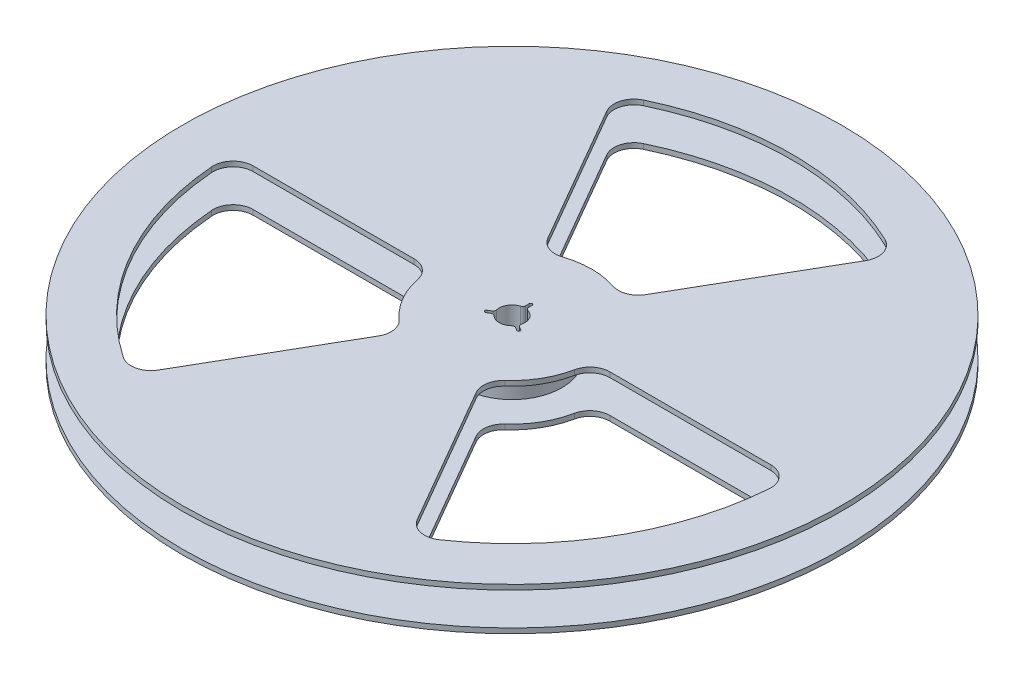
ISO-10303-21;
HEADER;
FILE_DESCRIPTION(('STEP AP214'),'2;1');
FILE_NAME('part.step','',(''),(''),'','','');
FILE_SCHEMA(('AUTOMOTIVE_DESIGN { 1 0 10303 214 1 1 1 1 }'));
ENDSEC;
DATA;
#1=APPLICATION_CONTEXT('core data for automotive mechanical design processes');
#2=APPLICATION_PROTOCOL_DEFINITION('international standard','automotive_design',2000,#1);
#3=PRODUCT_CONTEXT('',#1,'mechanical');
#4=PRODUCT('Part','Part','',(#3));
#5=PRODUCT_RELATED_PRODUCT_CATEGORY('part','',(#4));
#6=PRODUCT_DEFINITION_FORMATION('','',#4);
#7=PRODUCT_DEFINITION_CONTEXT('part definition',#1,'design');
#8=PRODUCT_DEFINITION('design','',#6,#7);
#9=PRODUCT_DEFINITION_SHAPE('','',#8);
#10=(LENGTH_UNIT() NAMED_UNIT(*) SI_UNIT(.MILLI.,.METRE.));
#11=(NAMED_UNIT(*) PLANE_ANGLE_UNIT() SI_UNIT($,.RADIAN.));
#12=(NAMED_UNIT(*) SI_UNIT($,.STERADIAN.) SOLID_ANGLE_UNIT());
#13=UNCERTAINTY_MEASURE_WITH_UNIT(LENGTH_MEASURE(1.E-05),#10,'distance_accuracy_value','');
#14=(GEOMETRIC_REPRESENTATION_CONTEXT(3) GLOBAL_UNCERTAINTY_ASSIGNED_CONTEXT((#13)) GLOBAL_UNIT_ASSIGNED_CONTEXT((#10,
#11,#12)) REPRESENTATION_CONTEXT('',''));
#15=CARTESIAN_POINT('',(0.,0.,0.));
#16=DIRECTION('',(0.,0.,1.));
#17=DIRECTION('',(1.,0.,0.));
#18=AXIS2_PLACEMENT_3D('',#15,#16,#17);
#19=CARTESIAN_POINT('',(0.,10.7,0.));
#20=DIRECTION('',(0.,-1.,0.));
#21=DIRECTION('',(0.,0.,-1.));
#22=AXIS2_PLACEMENT_3D('',#19,#20,#21);
#23=PLANE('',#22);
#24=DIRECTION('',(0.499999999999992,0.,0.866025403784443));
#25=VECTOR('',#24,1.);
#26=CARTESIAN_POINT('',(-24.4948974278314,10.7,-42.4264068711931));
#27=LINE('',#26,#25);
#28=CARTESIAN_POINT('',(-64.8074069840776,10.7,-112.249721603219));
#29=VERTEX_POINT('',#28);
#30=CARTESIAN_POINT('',(-24.4948974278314,10.7,-42.4264068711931));
#31=VERTEX_POINT('',#30);
#32=EDGE_CURVE('E494',#29,#31,#27,.T.);
#33=ORIENTED_EDGE('',*,*,#32,.F.);
#34=CARTESIAN_POINT('',(-56.1471529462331,10.7,-117.249721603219));
#35=DIRECTION('',(0.,1.,0.));
#36=DIRECTION('',(0.,0.,1.));
#37=AXIS2_PLACEMENT_3D('',#34,#35,#36);
#38=CIRCLE('',#37,9.99999999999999);
#39=CARTESIAN_POINT('',(-60.466164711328,10.7,-126.268930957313));
#40=VERTEX_POINT('',#39);
#41=EDGE_CURVE('E47',#40,#29,#38,.T.);
#42=ORIENTED_EDGE('',*,*,#41,.F.);
#43=CARTESIAN_POINT('',(0.,10.7,0.));
#44=DIRECTION('',(0.,1.,0.));
#45=DIRECTION('',(0.,0.,1.));
#46=AXIS2_PLACEMENT_3D('',#43,#44,#45);
#47=CIRCLE('',#46,140.);
#48=CARTESIAN_POINT('',(60.4661647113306,10.7,-126.268930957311));
#49=VERTEX_POINT('',#48);
#50=EDGE_CURVE('E474',#49,#40,#47,.T.);
#51=ORIENTED_EDGE('',*,*,#50,.F.);
#52=CARTESIAN_POINT('',(56.1471529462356,10.7,-117.249721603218));
#53=DIRECTION('',(0.,1.,0.));
#54=DIRECTION('',(0.,0.,1.));
#55=AXIS2_PLACEMENT_3D('',#52,#53,#54);
#56=CIRCLE('',#55,10.);
#57=CARTESIAN_POINT('',(64.8074069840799,10.7,-112.249721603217));
#58=VERTEX_POINT('',#57);
#59=EDGE_CURVE('E477',#58,#49,#56,.T.);
#60=ORIENTED_EDGE('',*,*,#59,.F.);
#61=DIRECTION('',(0.50000000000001,0.,-0.866025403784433));
#62=VECTOR('',#61,1.);
#63=CARTESIAN_POINT('',(24.4948974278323,10.7,-42.4264068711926));
#64=LINE('',#63,#62);
#65=CARTESIAN_POINT('',(24.4948974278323,10.7,-42.4264068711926));
#66=VERTEX_POINT('',#65);
#67=EDGE_CURVE('E505',#66,#58,#64,.T.);
#68=ORIENTED_EDGE('',*,*,#67,.F.);
#69=CARTESIAN_POINT('',(15.8346433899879,10.7,-47.4264068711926));
#70=DIRECTION('',(0.,1.,0.));
#71=DIRECTION('',(0.,0.,-1.));
#72=AXIS2_PLACEMENT_3D('',#69,#70,#71);
#73=CIRCLE('',#72,9.99999999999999);
#74=CARTESIAN_POINT('',(12.6677147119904,10.7,-37.9411254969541));
#75=VERTEX_POINT('',#74);
#76=EDGE_CURVE('E502',#75,#66,#73,.T.);
#77=ORIENTED_EDGE('',*,*,#76,.F.);
#78=CARTESIAN_POINT('',(0.,10.7,0.));
#79=DIRECTION('',(0.,-1.,0.));
#80=DIRECTION('',(0.,0.,1.));
#81=AXIS2_PLACEMENT_3D('',#78,#79,#80);
#82=CIRCLE('',#81,40.);
#83=CARTESIAN_POINT('',(-12.6677147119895,10.7,-37.9411254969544));
#84=VERTEX_POINT('',#83);
#85=EDGE_CURVE('E499',#84,#75,#82,.T.);
#86=ORIENTED_EDGE('',*,*,#85,.F.);
#87=CARTESIAN_POINT('',(-15.8346433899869,10.7,-47.426406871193));
#88=DIRECTION('',(0.,1.,0.));
#89=DIRECTION('',(0.,0.,1.));
#90=AXIS2_PLACEMENT_3D('',#87,#88,#89);
#91=CIRCLE('',#90,10.);
#92=EDGE_CURVE('E496',#31,#84,#91,.T.);
#93=ORIENTED_EDGE('',*,*,#92,.F.);
#94=EDGE_LOOP('',(#33,#42,#51,#60,#68,#77,#86,#93));
#95=FACE_BOUND('',#94,.T.);
#96=DIRECTION('',(0.500000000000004,0.,-0.866025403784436));
#97=VECTOR('',#96,1.);
#98=CARTESIAN_POINT('',(-24.494897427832,10.7,42.4264068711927));
#99=LINE('',#98,#97);
#100=CARTESIAN_POINT('',(-64.8074069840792,10.7,112.249721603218));
#101=VERTEX_POINT('',#100);
#102=CARTESIAN_POINT('',(-24.494897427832,10.7,42.4264068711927));
#103=VERTEX_POINT('',#102);
#104=EDGE_CURVE('E607',#101,#103,#99,.T.);
#105=ORIENTED_EDGE('',*,*,#104,.F.);
#106=CARTESIAN_POINT('',(-73.4676610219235,10.7,107.249721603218));
#107=DIRECTION('',(0.,1.,0.));
#108=DIRECTION('',(0.,0.,1.));
#109=AXIS2_PLACEMENT_3D('',#106,#107,#108);
#110=CIRCLE('',#109,10.);
#111=CARTESIAN_POINT('',(-79.1190195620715,10.7,115.499700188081));
#112=VERTEX_POINT('',#111);
#113=EDGE_CURVE('E579',#112,#101,#110,.T.);
#114=ORIENTED_EDGE('',*,*,#113,.F.);
#115=CARTESIAN_POINT('',(0.,10.7,0.));
#116=DIRECTION('',(0.,1.,0.));
#117=DIRECTION('',(0.,0.,1.));
#118=AXIS2_PLACEMENT_3D('',#115,#116,#117);
#119=CIRCLE('',#118,140.);
#120=CARTESIAN_POINT('',(-139.5851842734,10.7,10.7692307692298));
#121=VERTEX_POINT('',#120);
#122=EDGE_CURVE('E584',#121,#112,#119,.T.);
#123=ORIENTED_EDGE('',*,*,#122,.F.);
#124=CARTESIAN_POINT('',(-129.614813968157,10.7,9.99999999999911));
#125=DIRECTION('',(0.,1.,0.));
#126=DIRECTION('',(0.,0.,1.));
#127=AXIS2_PLACEMENT_3D('',#124,#125,#126);
#128=CIRCLE('',#127,10.);
#129=CARTESIAN_POINT('',(-129.614813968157,10.7,-9.15933995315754E-13));
#130=VERTEX_POINT('',#129);
#131=EDGE_CURVE('E622',#130,#121,#128,.T.);
#132=ORIENTED_EDGE('',*,*,#131,.F.);
#133=DIRECTION('',(-1.,0.,0.));
#134=VECTOR('',#133,1.);
#135=CARTESIAN_POINT('',(-48.9897948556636,10.7,-3.36536354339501E-13));
#136=LINE('',#135,#134);
#137=CARTESIAN_POINT('',(-48.9897948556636,10.7,-3.36536354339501E-13));
#138=VERTEX_POINT('',#137);
#139=EDGE_CURVE('E619',#138,#130,#136,.T.);
#140=ORIENTED_EDGE('',*,*,#139,.F.);
#141=CARTESIAN_POINT('',(-48.9897948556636,10.7,9.99999999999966));
#142=DIRECTION('',(0.,1.,0.));
#143=DIRECTION('',(0.,0.,-1.));
#144=AXIS2_PLACEMENT_3D('',#141,#142,#143);
#145=CIRCLE('',#144,9.99999999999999);
#146=CARTESIAN_POINT('',(-39.1918358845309,10.7,7.99999999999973));
#147=VERTEX_POINT('',#146);
#148=EDGE_CURVE('E616',#147,#138,#145,.T.);
#149=ORIENTED_EDGE('',*,*,#148,.F.);
#150=CARTESIAN_POINT('',(0.,10.7,0.));
#151=DIRECTION('',(0.,-1.,0.));
#152=DIRECTION('',(0.,0.,1.));
#153=AXIS2_PLACEMENT_3D('',#150,#151,#152);
#154=CIRCLE('',#153,40.);
#155=CARTESIAN_POINT('',(-26.5241211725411,10.7,29.9411254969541));
#156=VERTEX_POINT('',#155);
#157=EDGE_CURVE('E613',#156,#147,#154,.T.);
#158=ORIENTED_EDGE('',*,*,#157,.F.);
#159=CARTESIAN_POINT('',(-33.1551514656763,10.7,37.4264068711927));
#160=DIRECTION('',(0.,1.,0.));
#161=DIRECTION('',(0.,0.,1.));
#162=AXIS2_PLACEMENT_3D('',#159,#160,#161);
#163=CIRCLE('',#162,10.);
#164=EDGE_CURVE('E610',#103,#156,#163,.T.);
#165=ORIENTED_EDGE('',*,*,#164,.F.);
#166=EDGE_LOOP('',(#105,#114,#123,#132,#140,#149,#158,#165));
#167=FACE_BOUND('',#166,.T.);
#168=DIRECTION('',(-1.,0.,0.));
#169=VECTOR('',#168,1.);
#170=CARTESIAN_POINT('',(48.9897948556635,10.7,0.));
#171=LINE('',#170,#169);
#172=CARTESIAN_POINT('',(129.614813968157,10.7,0.));
#173=VERTEX_POINT('',#172);
#174=CARTESIAN_POINT('',(48.9897948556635,10.7,0.));
#175=VERTEX_POINT('',#174);
#176=EDGE_CURVE('E733',#173,#175,#171,.T.);
#177=ORIENTED_EDGE('',*,*,#176,.F.);
#178=CARTESIAN_POINT('',(129.614813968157,10.7,10.));
#179=DIRECTION('',(0.,1.,0.));
#180=DIRECTION('',(0.,0.,1.));
#181=AXIS2_PLACEMENT_3D('',#178,#179,#180);
#182=CIRCLE('',#181,10.);
#183=CARTESIAN_POINT('',(139.5851842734,10.7,10.7692307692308));
#184=VERTEX_POINT('',#183);
#185=EDGE_CURVE('E705',#184,#173,#182,.T.);
#186=ORIENTED_EDGE('',*,*,#185,.F.);
#187=CARTESIAN_POINT('',(0.,10.7,0.));
#188=DIRECTION('',(0.,1.,0.));
#189=DIRECTION('',(0.,0.,1.));
#190=AXIS2_PLACEMENT_3D('',#187,#188,#189);
#191=CIRCLE('',#190,140.);
#192=CARTESIAN_POINT('',(79.1190195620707,10.7,115.499700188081));
#193=VERTEX_POINT('',#192);
#194=EDGE_CURVE('E710',#193,#184,#191,.T.);
#195=ORIENTED_EDGE('',*,*,#194,.F.);
#196=CARTESIAN_POINT('',(73.4676610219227,10.7,107.249721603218));
#197=DIRECTION('',(0.,1.,0.));
#198=DIRECTION('',(0.,0.,1.));
#199=AXIS2_PLACEMENT_3D('',#196,#197,#198);
#200=CIRCLE('',#199,10.);
#201=CARTESIAN_POINT('',(64.8074069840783,10.7,112.249721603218));
#202=VERTEX_POINT('',#201);
#203=EDGE_CURVE('E748',#202,#193,#200,.T.);
#204=ORIENTED_EDGE('',*,*,#203,.F.);
#205=DIRECTION('',(0.499999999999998,0.,0.86602540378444));
#206=VECTOR('',#205,1.);
#207=CARTESIAN_POINT('',(24.4948974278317,10.7,42.4264068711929));
#208=LINE('',#207,#206);
#209=CARTESIAN_POINT('',(24.4948974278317,10.7,42.4264068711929));
#210=VERTEX_POINT('',#209);
#211=EDGE_CURVE('E745',#210,#202,#208,.T.);
#212=ORIENTED_EDGE('',*,*,#211,.F.);
#213=CARTESIAN_POINT('',(33.1551514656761,10.7,37.4264068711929));
#214=DIRECTION('',(0.,1.,0.));
#215=DIRECTION('',(0.,0.,-1.));
#216=AXIS2_PLACEMENT_3D('',#213,#214,#215);
#217=CIRCLE('',#216,9.99999999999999);
#218=CARTESIAN_POINT('',(26.5241211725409,10.7,29.9411254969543));
#219=VERTEX_POINT('',#218);
#220=EDGE_CURVE('E742',#219,#210,#217,.T.);
#221=ORIENTED_EDGE('',*,*,#220,.F.);
#222=CARTESIAN_POINT('',(0.,10.7,0.));
#223=DIRECTION('',(0.,-1.,0.));
#224=DIRECTION('',(0.,0.,1.));
#225=AXIS2_PLACEMENT_3D('',#222,#223,#224);
#226=CIRCLE('',#225,40.);
#227=CARTESIAN_POINT('',(39.1918358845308,10.7,8.));
#228=VERTEX_POINT('',#227);
#229=EDGE_CURVE('E739',#228,#219,#226,.T.);
#230=ORIENTED_EDGE('',*,*,#229,.F.);
#231=CARTESIAN_POINT('',(48.9897948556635,10.7,10.));
#232=DIRECTION('',(0.,1.,0.));
#233=DIRECTION('',(0.,0.,1.));
#234=AXIS2_PLACEMENT_3D('',#231,#232,#233);
#235=CIRCLE('',#234,10.);
#236=EDGE_CURVE('E736',#175,#228,#235,.T.);
#237=ORIENTED_EDGE('',*,*,#236,.F.);
#238=EDGE_LOOP('',(#177,#186,#195,#204,#212,#221,#230,#237));
#239=FACE_BOUND('',#238,.T.);
#240=CARTESIAN_POINT('',(0.,10.7,0.));
#241=DIRECTION('',(0.,1.,0.));
#242=DIRECTION('',(0.,0.,1.));
#243=AXIS2_PLACEMENT_3D('',#240,#241,#242);
#244=CIRCLE('',#243,6.39999999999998);
#245=CARTESIAN_POINT('',(-1.82278481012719,10.7,-6.13493728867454));
#246=VERTEX_POINT('',#245);
#247=CARTESIAN_POINT('',(-6.22440394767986,10.7,1.48889069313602));
#248=VERTEX_POINT('',#247);
#249=EDGE_CURVE('E886',#246,#248,#244,.T.);
#250=ORIENTED_EDGE('',*,*,#249,.F.);
#251=CARTESIAN_POINT('',(-2.25000000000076,10.7,-7.57281321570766));
#252=DIRECTION('',(0.,-1.,0.));
#253=DIRECTION('',(0.,0.,-1.));
#254=AXIS2_PLACEMENT_3D('',#251,#252,#253);
#255=CIRCLE('',#254,1.5);
#256=CARTESIAN_POINT('',(-0.750000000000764,10.7,-7.57281321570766));
#257=VERTEX_POINT('',#256);
#258=EDGE_CURVE('E831',#257,#246,#255,.T.);
#259=ORIENTED_EDGE('',*,*,#258,.F.);
#260=DIRECTION('',(0.,0.,1.));
#261=VECTOR('',#260,1.);
#262=CARTESIAN_POINT('',(-0.750000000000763,10.7,-9.35));
#263=LINE('',#262,#261);
#264=CARTESIAN_POINT('',(-0.75000000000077,10.7,-9.35));
#265=VERTEX_POINT('',#264);
#266=EDGE_CURVE('E836',#265,#257,#263,.T.);
#267=ORIENTED_EDGE('',*,*,#266,.F.);
#268=CARTESIAN_POINT('',(-7.69783542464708E-13,10.7,-9.35));
#269=DIRECTION('',(0.,1.,0.));
#270=DIRECTION('',(0.,0.,1.));
#271=AXIS2_PLACEMENT_3D('',#268,#269,#270);
#272=CIRCLE('',#271,0.75);
#273=CARTESIAN_POINT('',(0.749999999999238,10.7,-9.35));
#274=VERTEX_POINT('',#273);
#275=EDGE_CURVE('E931',#274,#265,#272,.T.);
#276=ORIENTED_EDGE('',*,*,#275,.F.);
#277=DIRECTION('',(0.,0.,1.));
#278=VECTOR('',#277,1.);
#279=CARTESIAN_POINT('',(0.749999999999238,10.7,-9.35));
#280=LINE('',#279,#278);
#281=CARTESIAN_POINT('',(0.749999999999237,10.7,-7.57281321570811));
#282=VERTEX_POINT('',#281);
#283=EDGE_CURVE('E928',#274,#282,#280,.T.);
#284=ORIENTED_EDGE('',*,*,#283,.T.);
#285=CARTESIAN_POINT('',(2.24999999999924,10.7,-7.57281321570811));
#286=DIRECTION('',(0.,-1.,0.));
#287=DIRECTION('',(0.,0.,-1.));
#288=AXIS2_PLACEMENT_3D('',#285,#286,#287);
#289=CIRCLE('',#288,1.5);
#290=CARTESIAN_POINT('',(1.82278481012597,10.7,-6.13493728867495));
#291=VERTEX_POINT('',#290);
#292=EDGE_CURVE('E925',#291,#282,#289,.T.);
#293=ORIENTED_EDGE('',*,*,#292,.F.);
#294=CARTESIAN_POINT('',(0.,10.7,0.));
#295=DIRECTION('',(0.,1.,0.));
#296=DIRECTION('',(0.,0.,1.));
#297=AXIS2_PLACEMENT_3D('',#294,#295,#296);
#298=CIRCLE('',#297,6.40000000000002);
#299=CARTESIAN_POINT('',(6.22440394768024,10.7,1.48889069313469));
#300=VERTEX_POINT('',#299);
#301=EDGE_CURVE('E922',#300,#291,#298,.T.);
#302=ORIENTED_EDGE('',*,*,#301,.F.);
#303=CARTESIAN_POINT('',(7.68324862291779,10.7,1.83784944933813));
#304=DIRECTION('',(0.,-1.,0.));
#305=DIRECTION('',(0.,0.,-1.));
#306=AXIS2_PLACEMENT_3D('',#303,#304,#305);
#307=CIRCLE('',#306,1.5);
#308=CARTESIAN_POINT('',(6.93324862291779,10.7,3.13688755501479));
#309=VERTEX_POINT('',#308);
#310=EDGE_CURVE('E919',#309,#300,#307,.T.);
#311=ORIENTED_EDGE('',*,*,#310,.F.);
#312=DIRECTION('',(-0.866025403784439,0.,-0.5));
#313=VECTOR('',#312,1.);
#314=CARTESIAN_POINT('',(8.47233752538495,10.7,4.02548094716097));
#315=LINE('',#314,#313);
#316=CARTESIAN_POINT('',(8.47233752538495,10.7,4.02548094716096));
#317=VERTEX_POINT('',#316);
#318=EDGE_CURVE('E916',#317,#309,#315,.T.);
#319=ORIENTED_EDGE('',*,*,#318,.F.);
#320=CARTESIAN_POINT('',(8.09733752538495,10.7,4.67499999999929));
#321=DIRECTION('',(0.,1.,0.));
#322=DIRECTION('',(0.,0.,1.));
#323=AXIS2_PLACEMENT_3D('',#320,#321,#322);
#324=CIRCLE('',#323,0.750000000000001);
#325=CARTESIAN_POINT('',(7.72233752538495,10.7,5.32451905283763));
#326=VERTEX_POINT('',#325);
#327=EDGE_CURVE('E913',#326,#317,#324,.T.);
#328=ORIENTED_EDGE('',*,*,#327,.F.);
#329=DIRECTION('',(-0.866025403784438,0.,-0.5));
#330=VECTOR('',#329,1.);
#331=CARTESIAN_POINT('',(7.72233752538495,10.7,5.32451905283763));
#332=LINE('',#331,#330);
#333=CARTESIAN_POINT('',(6.18324862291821,10.7,4.43592566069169));
#334=VERTEX_POINT('',#333);
#335=EDGE_CURVE('E910',#326,#334,#332,.T.);
#336=ORIENTED_EDGE('',*,*,#335,.T.);
#337=CARTESIAN_POINT('',(5.43324862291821,10.7,5.73496376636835));
#338=DIRECTION('',(0.,-1.,0.));
#339=DIRECTION('',(0.,0.,-1.));
#340=AXIS2_PLACEMENT_3D('',#337,#338,#339);
#341=CIRCLE('',#340,1.5);
#342=CARTESIAN_POINT('',(4.40161913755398,10.7,4.6460465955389));
#343=VERTEX_POINT('',#342);
#344=EDGE_CURVE('E907',#343,#334,#341,.T.);
#345=ORIENTED_EDGE('',*,*,#344,.F.);
#346=CARTESIAN_POINT('',(0.,10.7,0.));
#347=DIRECTION('',(0.,1.,0.));
#348=DIRECTION('',(0.,0.,1.));
#349=AXIS2_PLACEMENT_3D('',#346,#347,#348);
#350=CIRCLE('',#349,6.4);
#351=CARTESIAN_POINT('',(-4.40161913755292,10.7,4.64604659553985));
#352=VERTEX_POINT('',#351);
#353=EDGE_CURVE('E904',#352,#343,#350,.T.);
#354=ORIENTED_EDGE('',*,*,#353,.F.);
#355=CARTESIAN_POINT('',(-5.43324862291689,10.7,5.73496376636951));
#356=DIRECTION('',(0.,-1.,0.));
#357=DIRECTION('',(0.,0.,-1.));
#358=AXIS2_PLACEMENT_3D('',#355,#356,#357);
#359=CIRCLE('',#358,1.5);
#360=CARTESIAN_POINT('',(-6.18324862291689,10.7,4.43592566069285));
#361=VERTEX_POINT('',#360);
#362=EDGE_CURVE('E901',#361,#352,#359,.T.);
#363=ORIENTED_EDGE('',*,*,#362,.F.);
#364=DIRECTION('',(0.866025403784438,0.,-0.5));
#365=VECTOR('',#364,1.);
#366=CARTESIAN_POINT('',(-7.72233752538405,10.7,5.32451905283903));
#367=LINE('',#366,#365);
#368=CARTESIAN_POINT('',(-7.72233752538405,10.7,5.32451905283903));
#369=VERTEX_POINT('',#368);
#370=EDGE_CURVE('E898',#369,#361,#367,.T.);
#371=ORIENTED_EDGE('',*,*,#370,.F.);
#372=CARTESIAN_POINT('',(-8.09733752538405,10.7,4.6750000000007));
#373=DIRECTION('',(0.,1.,0.));
#374=DIRECTION('',(0.,0.,1.));
#375=AXIS2_PLACEMENT_3D('',#372,#373,#374);
#376=CIRCLE('',#375,0.750000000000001);
#377=CARTESIAN_POINT('',(-8.47233752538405,10.7,4.02548094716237));
#378=VERTEX_POINT('',#377);
#379=EDGE_CURVE('E895',#378,#369,#376,.T.);
#380=ORIENTED_EDGE('',*,*,#379,.F.);
#381=DIRECTION('',(0.866025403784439,0.,-0.5));
#382=VECTOR('',#381,1.);
#383=CARTESIAN_POINT('',(-8.47233752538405,10.7,4.02548094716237));
#384=LINE('',#383,#382);
#385=CARTESIAN_POINT('',(-6.93324862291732,10.7,3.13688755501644));
#386=VERTEX_POINT('',#385);
#387=EDGE_CURVE('E892',#378,#386,#384,.T.);
#388=ORIENTED_EDGE('',*,*,#387,.T.);
#389=CARTESIAN_POINT('',(-7.68324862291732,10.7,1.83784944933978));
#390=DIRECTION('',(0.,-1.,0.));
#391=DIRECTION('',(0.,0.,-1.));
#392=AXIS2_PLACEMENT_3D('',#389,#390,#391);
#393=CIRCLE('',#392,1.5);
#394=EDGE_CURVE('E889',#248,#386,#393,.T.);
#395=ORIENTED_EDGE('',*,*,#394,.F.);
#396=EDGE_LOOP('',(#250,#259,#267,#276,#284,#293,#302,#311,#319,#328,#336,#345,#354,#363,#371,
#380,#388,#395));
#397=FACE_BOUND('',#396,.T.);
#398=CARTESIAN_POINT('',(0.,10.7,0.));
#399=DIRECTION('',(0.,1.,0.));
#400=DIRECTION('',(0.,0.,1.));
#401=AXIS2_PLACEMENT_3D('',#398,#399,#400);
#402=CIRCLE('',#401,165.);
#403=CARTESIAN_POINT('',(0.,10.7,165.));
#404=VERTEX_POINT('',#403);
#405=EDGE_CURVE('E11',#404,#404,#402,.T.);
#406=ORIENTED_EDGE('',*,*,#405,.T.);
#407=EDGE_LOOP('',(#406));
#408=FACE_BOUND('',#407,.T.);
#409=ADVANCED_FACE('F33',(#95,#167,#239,#397,#408),#23,.F.);
#410=CARTESIAN_POINT('',(0.,8.2,0.));
#411=DIRECTION('',(0.,1.,0.));
#412=DIRECTION('',(0.,0.,1.));
#413=AXIS2_PLACEMENT_3D('',#410,#411,#412);
#414=CYLINDRICAL_SURFACE('',#413,165.);
#415=ORIENTED_EDGE('',*,*,#405,.F.);
#416=EDGE_LOOP('',(#415));
#417=FACE_BOUND('',#416,.T.);
#418=CARTESIAN_POINT('',(0.,8.2,0.));
#419=DIRECTION('',(0.,1.,0.));
#420=DIRECTION('',(0.,0.,1.));
#421=AXIS2_PLACEMENT_3D('',#418,#419,#420);
#422=CIRCLE('',#421,165.);
#423=CARTESIAN_POINT('',(0.,8.2,165.));
#424=VERTEX_POINT('',#423);
#425=EDGE_CURVE('E40',#424,#424,#422,.T.);
#426=ORIENTED_EDGE('',*,*,#425,.T.);
#427=EDGE_LOOP('',(#426));
#428=FACE_BOUND('',#427,.T.);
#429=ADVANCED_FACE('F986',(#417,#428),#414,.T.);
#430=CARTESIAN_POINT('',(25.,8.2,0.));
#431=DIRECTION('',(0.,1.,0.));
#432=DIRECTION('',(0.,0.,1.));
#433=AXIS2_PLACEMENT_3D('',#430,#431,#432);
#434=PLANE('',#433);
#435=CARTESIAN_POINT('',(0.,8.2,0.));
#436=DIRECTION('',(0.,1.,0.));
#437=DIRECTION('',(0.,0.,1.));
#438=AXIS2_PLACEMENT_3D('',#435,#436,#437);
#439=CIRCLE('',#438,140.);
#440=CARTESIAN_POINT('',(60.4661647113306,8.2,-126.268930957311));
#441=VERTEX_POINT('',#440);
#442=CARTESIAN_POINT('',(-60.466164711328,8.2,-126.268930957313));
#443=VERTEX_POINT('',#442);
#444=EDGE_CURVE('E572',#441,#443,#439,.T.);
#445=ORIENTED_EDGE('',*,*,#444,.T.);
#446=CARTESIAN_POINT('',(-56.1471529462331,8.2,-117.249721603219));
#447=DIRECTION('',(0.,1.,0.));
#448=DIRECTION('',(0.,0.,1.));
#449=AXIS2_PLACEMENT_3D('',#446,#447,#448);
#450=CIRCLE('',#449,9.99999999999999);
#451=CARTESIAN_POINT('',(-64.8074069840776,8.2,-112.249721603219));
#452=VERTEX_POINT('',#451);
#453=EDGE_CURVE('E576',#443,#452,#450,.T.);
#454=ORIENTED_EDGE('',*,*,#453,.T.);
#455=DIRECTION('',(0.499999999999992,0.,0.866025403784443));
#456=VECTOR('',#455,1.);
#457=CARTESIAN_POINT('',(6.24999999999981,8.2,10.8253175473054));
#458=LINE('',#457,#456);
#459=CARTESIAN_POINT('',(-24.4948974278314,8.2,-42.4264068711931));
#460=VERTEX_POINT('',#459);
#461=EDGE_CURVE('E536',#452,#460,#458,.T.);
#462=ORIENTED_EDGE('',*,*,#461,.T.);
#463=CARTESIAN_POINT('',(-15.8346433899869,8.2,-47.426406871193));
#464=DIRECTION('',(0.,1.,0.));
#465=DIRECTION('',(0.,0.,1.));
#466=AXIS2_PLACEMENT_3D('',#463,#464,#465);
#467=CIRCLE('',#466,10.);
#468=CARTESIAN_POINT('',(-12.6677147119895,8.2,-37.9411254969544));
#469=VERTEX_POINT('',#468);
#470=EDGE_CURVE('E542',#460,#469,#467,.T.);
#471=ORIENTED_EDGE('',*,*,#470,.T.);
#472=CARTESIAN_POINT('',(0.,8.2,0.));
#473=DIRECTION('',(0.,1.,0.));
#474=DIRECTION('',(0.,0.,1.));
#475=AXIS2_PLACEMENT_3D('',#472,#473,#474);
#476=CIRCLE('',#475,40.);
#477=CARTESIAN_POINT('',(12.6677147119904,8.2,-37.9411254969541));
#478=VERTEX_POINT('',#477);
#479=EDGE_CURVE('E548',#469,#478,#476,.F.);
#480=ORIENTED_EDGE('',*,*,#479,.T.);
#481=CARTESIAN_POINT('',(15.8346433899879,8.2,-47.4264068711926));
#482=DIRECTION('',(0.,1.,0.));
#483=DIRECTION('',(0.,0.,1.));
#484=AXIS2_PLACEMENT_3D('',#481,#482,#483);
#485=CIRCLE('',#484,9.99999999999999);
#486=CARTESIAN_POINT('',(24.4948974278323,8.2,-42.4264068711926));
#487=VERTEX_POINT('',#486);
#488=EDGE_CURVE('E554',#478,#487,#485,.T.);
#489=ORIENTED_EDGE('',*,*,#488,.T.);
#490=DIRECTION('',(0.50000000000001,0.,-0.866025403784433));
#491=VECTOR('',#490,1.);
#492=CARTESIAN_POINT('',(6.25000000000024,8.2,-10.8253175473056));
#493=LINE('',#492,#491);
#494=CARTESIAN_POINT('',(64.8074069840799,8.2,-112.249721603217));
#495=VERTEX_POINT('',#494);
#496=EDGE_CURVE('E560',#487,#495,#493,.T.);
#497=ORIENTED_EDGE('',*,*,#496,.T.);
#498=CARTESIAN_POINT('',(56.1471529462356,8.2,-117.249721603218));
#499=DIRECTION('',(0.,1.,0.));
#500=DIRECTION('',(0.,0.,1.));
#501=AXIS2_PLACEMENT_3D('',#498,#499,#500);
#502=CIRCLE('',#501,10.);
#503=EDGE_CURVE('E566',#495,#441,#502,.T.);
#504=ORIENTED_EDGE('',*,*,#503,.T.);
#505=EDGE_LOOP('',(#445,#454,#462,#471,#480,#489,#497,#504));
#506=FACE_BOUND('',#505,.T.);
#507=CARTESIAN_POINT('',(0.,8.2,0.));
#508=DIRECTION('',(0.,1.,0.));
#509=DIRECTION('',(0.,0.,1.));
#510=AXIS2_PLACEMENT_3D('',#507,#508,#509);
#511=CIRCLE('',#510,140.);
#512=CARTESIAN_POINT('',(-139.5851842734,8.2,10.7692307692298));
#513=VERTEX_POINT('',#512);
#514=CARTESIAN_POINT('',(-79.1190195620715,8.2,115.499700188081));
#515=VERTEX_POINT('',#514);
#516=EDGE_CURVE('E696',#513,#515,#511,.T.);
#517=ORIENTED_EDGE('',*,*,#516,.T.);
#518=CARTESIAN_POINT('',(-73.4676610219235,8.2,107.249721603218));
#519=DIRECTION('',(0.,1.,0.));
#520=DIRECTION('',(0.,0.,1.));
#521=AXIS2_PLACEMENT_3D('',#518,#519,#520);
#522=CIRCLE('',#521,10.);
#523=CARTESIAN_POINT('',(-64.8074069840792,8.2,112.249721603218));
#524=VERTEX_POINT('',#523);
#525=EDGE_CURVE('E702',#515,#524,#522,.T.);
#526=ORIENTED_EDGE('',*,*,#525,.T.);
#527=DIRECTION('',(0.500000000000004,0.,-0.866025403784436));
#528=VECTOR('',#527,1.);
#529=CARTESIAN_POINT('',(6.2500000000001,8.2,-10.8253175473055));
#530=LINE('',#529,#528);
#531=CARTESIAN_POINT('',(-24.494897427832,8.2,42.4264068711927));
#532=VERTEX_POINT('',#531);
#533=EDGE_CURVE('E660',#524,#532,#530,.T.);
#534=ORIENTED_EDGE('',*,*,#533,.T.);
#535=CARTESIAN_POINT('',(-33.1551514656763,8.2,37.4264068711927));
#536=DIRECTION('',(0.,1.,0.));
#537=DIRECTION('',(0.,0.,1.));
#538=AXIS2_PLACEMENT_3D('',#535,#536,#537);
#539=CIRCLE('',#538,10.);
#540=CARTESIAN_POINT('',(-26.5241211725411,8.2,29.9411254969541));
#541=VERTEX_POINT('',#540);
#542=EDGE_CURVE('E666',#532,#541,#539,.T.);
#543=ORIENTED_EDGE('',*,*,#542,.T.);
#544=CARTESIAN_POINT('',(0.,8.2,0.));
#545=DIRECTION('',(0.,1.,0.));
#546=DIRECTION('',(0.,0.,1.));
#547=AXIS2_PLACEMENT_3D('',#544,#545,#546);
#548=CIRCLE('',#547,40.);
#549=CARTESIAN_POINT('',(-39.1918358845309,8.2,7.99999999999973));
#550=VERTEX_POINT('',#549);
#551=EDGE_CURVE('E672',#541,#550,#548,.F.);
#552=ORIENTED_EDGE('',*,*,#551,.T.);
#553=CARTESIAN_POINT('',(-48.9897948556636,8.2,9.99999999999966));
#554=DIRECTION('',(0.,1.,0.));
#555=DIRECTION('',(0.,0.,1.));
#556=AXIS2_PLACEMENT_3D('',#553,#554,#555);
#557=CIRCLE('',#556,9.99999999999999);
#558=CARTESIAN_POINT('',(-48.9897948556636,8.2,-3.36536354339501E-13));
#559=VERTEX_POINT('',#558);
#560=EDGE_CURVE('E678',#550,#559,#557,.T.);
#561=ORIENTED_EDGE('',*,*,#560,.T.);
#562=DIRECTION('',(-1.,0.,0.));
#563=VECTOR('',#562,1.);
#564=CARTESIAN_POINT('',(25.,8.2,1.76074880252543E-13));
#565=LINE('',#564,#563);
#566=CARTESIAN_POINT('',(-129.614813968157,8.2,-9.15933995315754E-13));
#567=VERTEX_POINT('',#566);
#568=EDGE_CURVE('E684',#559,#567,#565,.T.);
#569=ORIENTED_EDGE('',*,*,#568,.T.);
#570=CARTESIAN_POINT('',(-129.614813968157,8.2,9.99999999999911));
#571=DIRECTION('',(0.,1.,0.));
#572=DIRECTION('',(0.,0.,1.));
#573=AXIS2_PLACEMENT_3D('',#570,#571,#572);
#574=CIRCLE('',#573,10.);
#575=EDGE_CURVE('E690',#567,#513,#574,.T.);
#576=ORIENTED_EDGE('',*,*,#575,.T.);
#577=EDGE_LOOP('',(#517,#526,#534,#543,#552,#561,#569,#576));
#578=FACE_BOUND('',#577,.T.);
#579=CARTESIAN_POINT('',(0.,8.2,0.));
#580=DIRECTION('',(0.,1.,0.));
#581=DIRECTION('',(0.,0.,1.));
#582=AXIS2_PLACEMENT_3D('',#579,#580,#581);
#583=CIRCLE('',#582,140.);
#584=CARTESIAN_POINT('',(79.1190195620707,8.2,115.499700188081));
#585=VERTEX_POINT('',#584);
#586=CARTESIAN_POINT('',(139.5851842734,8.2,10.7692307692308));
#587=VERTEX_POINT('',#586);
#588=EDGE_CURVE('E822',#585,#587,#583,.T.);
#589=ORIENTED_EDGE('',*,*,#588,.T.);
#590=CARTESIAN_POINT('',(129.614813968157,8.2,10.));
#591=DIRECTION('',(0.,1.,0.));
#592=DIRECTION('',(0.,0.,1.));
#593=AXIS2_PLACEMENT_3D('',#590,#591,#592);
#594=CIRCLE('',#593,10.);
#595=CARTESIAN_POINT('',(129.614813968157,8.2,0.));
#596=VERTEX_POINT('',#595);
#597=EDGE_CURVE('E828',#587,#596,#594,.T.);
#598=ORIENTED_EDGE('',*,*,#597,.T.);
#599=DIRECTION('',(-1.,0.,0.));
#600=VECTOR('',#599,1.);
#601=CARTESIAN_POINT('',(25.,8.2,0.));
#602=LINE('',#601,#600);
#603=CARTESIAN_POINT('',(48.9897948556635,8.2,0.));
#604=VERTEX_POINT('',#603);
#605=EDGE_CURVE('E786',#596,#604,#602,.T.);
#606=ORIENTED_EDGE('',*,*,#605,.T.);
#607=CARTESIAN_POINT('',(48.9897948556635,8.2,10.));
#608=DIRECTION('',(0.,1.,0.));
#609=DIRECTION('',(0.,0.,1.));
#610=AXIS2_PLACEMENT_3D('',#607,#608,#609);
#611=CIRCLE('',#610,10.);
#612=CARTESIAN_POINT('',(39.1918358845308,8.2,8.));
#613=VERTEX_POINT('',#612);
#614=EDGE_CURVE('E792',#604,#613,#611,.T.);
#615=ORIENTED_EDGE('',*,*,#614,.T.);
#616=CARTESIAN_POINT('',(0.,8.2,0.));
#617=DIRECTION('',(0.,1.,0.));
#618=DIRECTION('',(0.,0.,1.));
#619=AXIS2_PLACEMENT_3D('',#616,#617,#618);
#620=CIRCLE('',#619,40.);
#621=CARTESIAN_POINT('',(26.5241211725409,8.2,29.9411254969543));
#622=VERTEX_POINT('',#621);
#623=EDGE_CURVE('E798',#613,#622,#620,.F.);
#624=ORIENTED_EDGE('',*,*,#623,.T.);
#625=CARTESIAN_POINT('',(33.1551514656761,8.2,37.4264068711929));
#626=DIRECTION('',(0.,1.,0.));
#627=DIRECTION('',(0.,0.,1.));
#628=AXIS2_PLACEMENT_3D('',#625,#626,#627);
#629=CIRCLE('',#628,9.99999999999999);
#630=CARTESIAN_POINT('',(24.4948974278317,8.2,42.4264068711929));
#631=VERTEX_POINT('',#630);
#632=EDGE_CURVE('E804',#622,#631,#629,.T.);
#633=ORIENTED_EDGE('',*,*,#632,.T.);
#634=DIRECTION('',(0.499999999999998,0.,0.86602540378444));
#635=VECTOR('',#634,1.);
#636=CARTESIAN_POINT('',(6.24999999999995,8.2,10.8253175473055));
#637=LINE('',#636,#635);
#638=CARTESIAN_POINT('',(64.8074069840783,8.2,112.249721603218));
#639=VERTEX_POINT('',#638);
#640=EDGE_CURVE('E810',#631,#639,#637,.T.);
#641=ORIENTED_EDGE('',*,*,#640,.T.);
#642=CARTESIAN_POINT('',(73.4676610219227,8.2,107.249721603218));
#643=DIRECTION('',(0.,1.,0.));
#644=DIRECTION('',(0.,0.,1.));
#645=AXIS2_PLACEMENT_3D('',#642,#643,#644);
#646=CIRCLE('',#645,10.);
#647=EDGE_CURVE('E816',#639,#585,#646,.T.);
#648=ORIENTED_EDGE('',*,*,#647,.T.);
#649=EDGE_LOOP('',(#589,#598,#606,#615,#624,#633,#641,#648));
#650=FACE_BOUND('',#649,.T.);
#651=ORIENTED_EDGE('',*,*,#425,.F.);
#652=EDGE_LOOP('',(#651));
#653=FACE_BOUND('',#652,.T.);
#654=CARTESIAN_POINT('',(0.,8.2,0.));
#655=DIRECTION('',(0.,1.,0.));
#656=DIRECTION('',(0.,0.,1.));
#657=AXIS2_PLACEMENT_3D('',#654,#655,#656);
#658=CIRCLE('',#657,25.);
#659=CARTESIAN_POINT('',(0.,8.2,25.));
#660=VERTEX_POINT('',#659);
#661=EDGE_CURVE('E981',#660,#660,#658,.T.);
#662=ORIENTED_EDGE('',*,*,#661,.T.);
#663=EDGE_LOOP('',(#662));
#664=FACE_BOUND('',#663,.T.);
#665=ADVANCED_FACE('F988',(#506,#578,#650,#653,#664),#434,.F.);
#666=CARTESIAN_POINT('',(0.,8.2,0.));
#667=DIRECTION('',(0.,1.,0.));
#668=DIRECTION('',(0.,0.,1.));
#669=AXIS2_PLACEMENT_3D('',#666,#667,#668);
#670=CYLINDRICAL_SURFACE('',#669,25.);
#671=ORIENTED_EDGE('',*,*,#661,.F.);
#672=EDGE_LOOP('',(#671));
#673=FACE_BOUND('',#672,.T.);
#674=CARTESIAN_POINT('',(0.,-8.2,0.));
#675=DIRECTION('',(0.,1.,0.));
#676=DIRECTION('',(0.,0.,1.));
#677=AXIS2_PLACEMENT_3D('',#674,#675,#676);
#678=CIRCLE('',#677,25.);
#679=CARTESIAN_POINT('',(0.,-8.2,25.));
#680=VERTEX_POINT('',#679);
#681=EDGE_CURVE('E978',#680,#680,#678,.T.);
#682=ORIENTED_EDGE('',*,*,#681,.T.);
#683=EDGE_LOOP('',(#682));
#684=FACE_BOUND('',#683,.T.);
#685=ADVANCED_FACE('F991',(#673,#684),#670,.T.);
#686=CARTESIAN_POINT('',(25.,-8.2,0.));
#687=DIRECTION('',(0.,-1.,0.));
#688=DIRECTION('',(0.,0.,-1.));
#689=AXIS2_PLACEMENT_3D('',#686,#687,#688);
#690=PLANE('',#689);
#691=DIRECTION('',(-0.499999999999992,0.,-0.866025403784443));
#692=VECTOR('',#691,1.);
#693=CARTESIAN_POINT('',(6.24999999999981,-8.2,10.8253175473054));
#694=LINE('',#693,#692);
#695=CARTESIAN_POINT('',(-24.4948974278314,-8.2,-42.4264068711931));
#696=VERTEX_POINT('',#695);
#697=CARTESIAN_POINT('',(-64.8074069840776,-8.2,-112.249721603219));
#698=VERTEX_POINT('',#697);
#699=EDGE_CURVE('E512',#696,#698,#694,.T.);
#700=ORIENTED_EDGE('',*,*,#699,.T.);
#701=CARTESIAN_POINT('',(-56.1471529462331,-8.2,-117.249721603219));
#702=DIRECTION('',(0.,-1.,0.));
#703=DIRECTION('',(0.,0.,-1.));
#704=AXIS2_PLACEMENT_3D('',#701,#702,#703);
#705=CIRCLE('',#704,9.99999999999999);
#706=CARTESIAN_POINT('',(-60.466164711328,-8.2,-126.268930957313));
#707=VERTEX_POINT('',#706);
#708=EDGE_CURVE('E454',#698,#707,#705,.T.);
#709=ORIENTED_EDGE('',*,*,#708,.T.);
#710=CARTESIAN_POINT('',(0.,-8.2,0.));
#711=DIRECTION('',(0.,-1.,0.));
#712=DIRECTION('',(0.,0.,-1.));
#713=AXIS2_PLACEMENT_3D('',#710,#711,#712);
#714=CIRCLE('',#713,140.);
#715=CARTESIAN_POINT('',(60.4661647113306,-8.2,-126.268930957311));
#716=VERTEX_POINT('',#715);
#717=EDGE_CURVE('E569',#707,#716,#714,.T.);
#718=ORIENTED_EDGE('',*,*,#717,.T.);
#719=CARTESIAN_POINT('',(56.1471529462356,-8.2,-117.249721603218));
#720=DIRECTION('',(0.,-1.,0.));
#721=DIRECTION('',(0.,0.,-1.));
#722=AXIS2_PLACEMENT_3D('',#719,#720,#721);
#723=CIRCLE('',#722,10.);
#724=CARTESIAN_POINT('',(64.8074069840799,-8.2,-112.249721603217));
#725=VERTEX_POINT('',#724);
#726=EDGE_CURVE('E563',#716,#725,#723,.T.);
#727=ORIENTED_EDGE('',*,*,#726,.T.);
#728=DIRECTION('',(-0.50000000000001,0.,0.866025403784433));
#729=VECTOR('',#728,1.);
#730=CARTESIAN_POINT('',(6.25000000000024,-8.2,-10.8253175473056));
#731=LINE('',#730,#729);
#732=CARTESIAN_POINT('',(24.4948974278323,-8.2,-42.4264068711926));
#733=VERTEX_POINT('',#732);
#734=EDGE_CURVE('E557',#725,#733,#731,.T.);
#735=ORIENTED_EDGE('',*,*,#734,.T.);
#736=CARTESIAN_POINT('',(15.8346433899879,-8.2,-47.4264068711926));
#737=DIRECTION('',(0.,-1.,0.));
#738=DIRECTION('',(0.,0.,-1.));
#739=AXIS2_PLACEMENT_3D('',#736,#737,#738);
#740=CIRCLE('',#739,9.99999999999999);
#741=CARTESIAN_POINT('',(12.6677147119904,-8.2,-37.9411254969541));
#742=VERTEX_POINT('',#741);
#743=EDGE_CURVE('E551',#733,#742,#740,.T.);
#744=ORIENTED_EDGE('',*,*,#743,.T.);
#745=CARTESIAN_POINT('',(0.,-8.2,0.));
#746=DIRECTION('',(0.,-1.,0.));
#747=DIRECTION('',(0.,0.,-1.));
#748=AXIS2_PLACEMENT_3D('',#745,#746,#747);
#749=CIRCLE('',#748,40.);
#750=CARTESIAN_POINT('',(-12.6677147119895,-8.2,-37.9411254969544));
#751=VERTEX_POINT('',#750);
#752=EDGE_CURVE('E545',#742,#751,#749,.F.);
#753=ORIENTED_EDGE('',*,*,#752,.T.);
#754=CARTESIAN_POINT('',(-15.8346433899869,-8.2,-47.426406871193));
#755=DIRECTION('',(0.,-1.,0.));
#756=DIRECTION('',(0.,0.,-1.));
#757=AXIS2_PLACEMENT_3D('',#754,#755,#756);
#758=CIRCLE('',#757,10.);
#759=EDGE_CURVE('E539',#751,#696,#758,.T.);
#760=ORIENTED_EDGE('',*,*,#759,.T.);
#761=EDGE_LOOP('',(#700,#709,#718,#727,#735,#744,#753,#760));
#762=FACE_BOUND('',#761,.T.);
#763=DIRECTION('',(-0.500000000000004,0.,0.866025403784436));
#764=VECTOR('',#763,1.);
#765=CARTESIAN_POINT('',(6.2500000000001,-8.2,-10.8253175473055));
#766=LINE('',#765,#764);
#767=CARTESIAN_POINT('',(-24.494897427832,-8.2,42.4264068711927));
#768=VERTEX_POINT('',#767);
#769=CARTESIAN_POINT('',(-64.8074069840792,-8.2,112.249721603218));
#770=VERTEX_POINT('',#769);
#771=EDGE_CURVE('E630',#768,#770,#766,.T.);
#772=ORIENTED_EDGE('',*,*,#771,.T.);
#773=CARTESIAN_POINT('',(-73.4676610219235,-8.2,107.249721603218));
#774=DIRECTION('',(0.,-1.,0.));
#775=DIRECTION('',(0.,0.,-1.));
#776=AXIS2_PLACEMENT_3D('',#773,#774,#775);
#777=CIRCLE('',#776,10.);
#778=CARTESIAN_POINT('',(-79.1190195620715,-8.2,115.499700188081));
#779=VERTEX_POINT('',#778);
#780=EDGE_CURVE('E699',#770,#779,#777,.T.);
#781=ORIENTED_EDGE('',*,*,#780,.T.);
#782=CARTESIAN_POINT('',(0.,-8.2,0.));
#783=DIRECTION('',(0.,-1.,0.));
#784=DIRECTION('',(0.,0.,-1.));
#785=AXIS2_PLACEMENT_3D('',#782,#783,#784);
#786=CIRCLE('',#785,140.);
#787=CARTESIAN_POINT('',(-139.5851842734,-8.2,10.7692307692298));
#788=VERTEX_POINT('',#787);
#789=EDGE_CURVE('E693',#779,#788,#786,.T.);
#790=ORIENTED_EDGE('',*,*,#789,.T.);
#791=CARTESIAN_POINT('',(-129.614813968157,-8.2,9.99999999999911));
#792=DIRECTION('',(0.,-1.,0.));
#793=DIRECTION('',(0.,0.,-1.));
#794=AXIS2_PLACEMENT_3D('',#791,#792,#793);
#795=CIRCLE('',#794,10.);
#796=CARTESIAN_POINT('',(-129.614813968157,-8.2,-9.15933995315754E-13));
#797=VERTEX_POINT('',#796);
#798=EDGE_CURVE('E687',#788,#797,#795,.T.);
#799=ORIENTED_EDGE('',*,*,#798,.T.);
#800=DIRECTION('',(1.,0.,0.));
#801=VECTOR('',#800,1.);
#802=CARTESIAN_POINT('',(25.,-8.2,1.76074880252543E-13));
#803=LINE('',#802,#801);
#804=CARTESIAN_POINT('',(-48.9897948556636,-8.2,-3.36536354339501E-13));
#805=VERTEX_POINT('',#804);
#806=EDGE_CURVE('E681',#797,#805,#803,.T.);
#807=ORIENTED_EDGE('',*,*,#806,.T.);
#808=CARTESIAN_POINT('',(-48.9897948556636,-8.2,9.99999999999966));
#809=DIRECTION('',(0.,-1.,0.));
#810=DIRECTION('',(0.,0.,-1.));
#811=AXIS2_PLACEMENT_3D('',#808,#809,#810);
#812=CIRCLE('',#811,9.99999999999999);
#813=CARTESIAN_POINT('',(-39.1918358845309,-8.2,7.99999999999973));
#814=VERTEX_POINT('',#813);
#815=EDGE_CURVE('E675',#805,#814,#812,.T.);
#816=ORIENTED_EDGE('',*,*,#815,.T.);
#817=CARTESIAN_POINT('',(0.,-8.2,0.));
#818=DIRECTION('',(0.,-1.,0.));
#819=DIRECTION('',(0.,0.,-1.));
#820=AXIS2_PLACEMENT_3D('',#817,#818,#819);
#821=CIRCLE('',#820,40.);
#822=CARTESIAN_POINT('',(-26.5241211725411,-8.2,29.9411254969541));
#823=VERTEX_POINT('',#822);
#824=EDGE_CURVE('E669',#814,#823,#821,.F.);
#825=ORIENTED_EDGE('',*,*,#824,.T.);
#826=CARTESIAN_POINT('',(-33.1551514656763,-8.2,37.4264068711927));
#827=DIRECTION('',(0.,-1.,0.));
#828=DIRECTION('',(0.,0.,-1.));
#829=AXIS2_PLACEMENT_3D('',#826,#827,#828);
#830=CIRCLE('',#829,10.);
#831=EDGE_CURVE('E663',#823,#768,#830,.T.);
#832=ORIENTED_EDGE('',*,*,#831,.T.);
#833=EDGE_LOOP('',(#772,#781,#790,#799,#807,#816,#825,#832));
#834=FACE_BOUND('',#833,.T.);
#835=DIRECTION('',(1.,0.,0.));
#836=VECTOR('',#835,1.);
#837=CARTESIAN_POINT('',(25.,-8.2,0.));
#838=LINE('',#837,#836);
#839=CARTESIAN_POINT('',(48.9897948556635,-8.2,0.));
#840=VERTEX_POINT('',#839);
#841=CARTESIAN_POINT('',(129.614813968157,-8.2,0.));
#842=VERTEX_POINT('',#841);
#843=EDGE_CURVE('E756',#840,#842,#838,.T.);
#844=ORIENTED_EDGE('',*,*,#843,.T.);
#845=CARTESIAN_POINT('',(129.614813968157,-8.2,10.));
#846=DIRECTION('',(0.,-1.,0.));
#847=DIRECTION('',(0.,0.,-1.));
#848=AXIS2_PLACEMENT_3D('',#845,#846,#847);
#849=CIRCLE('',#848,10.);
#850=CARTESIAN_POINT('',(139.5851842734,-8.2,10.7692307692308));
#851=VERTEX_POINT('',#850);
#852=EDGE_CURVE('E825',#842,#851,#849,.T.);
#853=ORIENTED_EDGE('',*,*,#852,.T.);
#854=CARTESIAN_POINT('',(0.,-8.2,0.));
#855=DIRECTION('',(0.,-1.,0.));
#856=DIRECTION('',(0.,0.,-1.));
#857=AXIS2_PLACEMENT_3D('',#854,#855,#856);
#858=CIRCLE('',#857,140.);
#859=CARTESIAN_POINT('',(79.1190195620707,-8.2,115.499700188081));
#860=VERTEX_POINT('',#859);
#861=EDGE_CURVE('E819',#851,#860,#858,.T.);
#862=ORIENTED_EDGE('',*,*,#861,.T.);
#863=CARTESIAN_POINT('',(73.4676610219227,-8.2,107.249721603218));
#864=DIRECTION('',(0.,-1.,0.));
#865=DIRECTION('',(0.,0.,-1.));
#866=AXIS2_PLACEMENT_3D('',#863,#864,#865);
#867=CIRCLE('',#866,10.);
#868=CARTESIAN_POINT('',(64.8074069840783,-8.2,112.249721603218));
#869=VERTEX_POINT('',#868);
#870=EDGE_CURVE('E813',#860,#869,#867,.T.);
#871=ORIENTED_EDGE('',*,*,#870,.T.);
#872=DIRECTION('',(-0.499999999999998,0.,-0.86602540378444));
#873=VECTOR('',#872,1.);
#874=CARTESIAN_POINT('',(6.24999999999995,-8.2,10.8253175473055));
#875=LINE('',#874,#873);
#876=CARTESIAN_POINT('',(24.4948974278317,-8.2,42.4264068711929));
#877=VERTEX_POINT('',#876);
#878=EDGE_CURVE('E807',#869,#877,#875,.T.);
#879=ORIENTED_EDGE('',*,*,#878,.T.);
#880=CARTESIAN_POINT('',(33.1551514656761,-8.2,37.4264068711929));
#881=DIRECTION('',(0.,-1.,0.));
#882=DIRECTION('',(0.,0.,-1.));
#883=AXIS2_PLACEMENT_3D('',#880,#881,#882);
#884=CIRCLE('',#883,9.99999999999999);
#885=CARTESIAN_POINT('',(26.5241211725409,-8.2,29.9411254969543));
#886=VERTEX_POINT('',#885);
#887=EDGE_CURVE('E801',#877,#886,#884,.T.);
#888=ORIENTED_EDGE('',*,*,#887,.T.);
#889=CARTESIAN_POINT('',(0.,-8.2,0.));
#890=DIRECTION('',(0.,-1.,0.));
#891=DIRECTION('',(0.,0.,-1.));
#892=AXIS2_PLACEMENT_3D('',#889,#890,#891);
#893=CIRCLE('',#892,40.);
#894=CARTESIAN_POINT('',(39.1918358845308,-8.2,8.));
#895=VERTEX_POINT('',#894);
#896=EDGE_CURVE('E795',#886,#895,#893,.F.);
#897=ORIENTED_EDGE('',*,*,#896,.T.);
#898=CARTESIAN_POINT('',(48.9897948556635,-8.2,10.));
#899=DIRECTION('',(0.,-1.,0.));
#900=DIRECTION('',(0.,0.,-1.));
#901=AXIS2_PLACEMENT_3D('',#898,#899,#900);
#902=CIRCLE('',#901,10.);
#903=EDGE_CURVE('E789',#895,#840,#902,.T.);
#904=ORIENTED_EDGE('',*,*,#903,.T.);
#905=EDGE_LOOP('',(#844,#853,#862,#871,#879,#888,#897,#904));
#906=FACE_BOUND('',#905,.T.);
#907=ORIENTED_EDGE('',*,*,#681,.F.);
#908=EDGE_LOOP('',(#907));
#909=FACE_BOUND('',#908,.T.);
#910=CARTESIAN_POINT('',(0.,-8.2,0.));
#911=DIRECTION('',(0.,1.,0.));
#912=DIRECTION('',(0.,0.,1.));
#913=AXIS2_PLACEMENT_3D('',#910,#911,#912);
#914=CIRCLE('',#913,165.);
#915=CARTESIAN_POINT('',(0.,-8.2,165.));
#916=VERTEX_POINT('',#915);
#917=EDGE_CURVE('E975',#916,#916,#914,.T.);
#918=ORIENTED_EDGE('',*,*,#917,.T.);
#919=EDGE_LOOP('',(#918));
#920=FACE_BOUND('',#919,.T.);
#921=ADVANCED_FACE('F998',(#762,#834,#906,#909,#920),#690,.F.);
#922=CARTESIAN_POINT('',(0.,8.2,0.));
#923=DIRECTION('',(0.,1.,0.));
#924=DIRECTION('',(0.,0.,1.));
#925=AXIS2_PLACEMENT_3D('',#922,#923,#924);
#926=CYLINDRICAL_SURFACE('',#925,165.);
#927=ORIENTED_EDGE('',*,*,#917,.F.);
#928=EDGE_LOOP('',(#927));
#929=FACE_BOUND('',#928,.T.);
#930=CARTESIAN_POINT('',(0.,-10.7,0.));
#931=DIRECTION('',(0.,1.,0.));
#932=DIRECTION('',(0.,0.,1.));
#933=AXIS2_PLACEMENT_3D('',#930,#931,#932);
#934=CIRCLE('',#933,165.);
#935=CARTESIAN_POINT('',(0.,-10.7,165.));
#936=VERTEX_POINT('',#935);
#937=EDGE_CURVE('E938',#936,#936,#934,.T.);
#938=ORIENTED_EDGE('',*,*,#937,.T.);
#939=EDGE_LOOP('',(#938));
#940=FACE_BOUND('',#939,.T.);
#941=ADVANCED_FACE('F1004',(#929,#940),#926,.T.);
#942=CARTESIAN_POINT('',(0.,-10.7,0.));
#943=DIRECTION('',(0.,1.,0.));
#944=DIRECTION('',(0.,0.,1.));
#945=AXIS2_PLACEMENT_3D('',#942,#943,#944);
#946=PLANE('',#945);
#947=CARTESIAN_POINT('',(0.,-10.7,0.));
#948=DIRECTION('',(0.,1.,0.));
#949=DIRECTION('',(0.,0.,1.));
#950=AXIS2_PLACEMENT_3D('',#947,#948,#949);
#951=CIRCLE('',#950,140.);
#952=CARTESIAN_POINT('',(60.4661647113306,-10.7,-126.268930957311));
#953=VERTEX_POINT('',#952);
#954=CARTESIAN_POINT('',(-60.466164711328,-10.7,-126.268930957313));
#955=VERTEX_POINT('',#954);
#956=EDGE_CURVE('E473',#953,#955,#951,.T.);
#957=ORIENTED_EDGE('',*,*,#956,.T.);
#958=CARTESIAN_POINT('',(-56.1471529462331,-10.7,-117.249721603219));
#959=DIRECTION('',(0.,1.,0.));
#960=DIRECTION('',(0.,0.,1.));
#961=AXIS2_PLACEMENT_3D('',#958,#959,#960);
#962=CIRCLE('',#961,9.99999999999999);
#963=CARTESIAN_POINT('',(-64.8074069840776,-10.7,-112.249721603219));
#964=VERTEX_POINT('',#963);
#965=EDGE_CURVE('E451',#955,#964,#962,.T.);
#966=ORIENTED_EDGE('',*,*,#965,.T.);
#967=DIRECTION('',(0.499999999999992,0.,0.866025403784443));
#968=VECTOR('',#967,1.);
#969=CARTESIAN_POINT('',(-24.4948974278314,-10.7,-42.4264068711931));
#970=LINE('',#969,#968);
#971=CARTESIAN_POINT('',(-24.4948974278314,-10.7,-42.4264068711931));
#972=VERTEX_POINT('',#971);
#973=EDGE_CURVE('E461',#964,#972,#970,.T.);
#974=ORIENTED_EDGE('',*,*,#973,.T.);
#975=CARTESIAN_POINT('',(-15.8346433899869,-10.7,-47.426406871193));
#976=DIRECTION('',(0.,1.,0.));
#977=DIRECTION('',(0.,0.,1.));
#978=AXIS2_PLACEMENT_3D('',#975,#976,#977);
#979=CIRCLE('',#978,10.);
#980=CARTESIAN_POINT('',(-12.6677147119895,-10.7,-37.9411254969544));
#981=VERTEX_POINT('',#980);
#982=EDGE_CURVE('E467',#972,#981,#979,.T.);
#983=ORIENTED_EDGE('',*,*,#982,.T.);
#984=CARTESIAN_POINT('',(0.,-10.7,0.));
#985=DIRECTION('',(0.,-1.,0.));
#986=DIRECTION('',(0.,0.,1.));
#987=AXIS2_PLACEMENT_3D('',#984,#985,#986);
#988=CIRCLE('',#987,40.);
#989=CARTESIAN_POINT('',(12.6677147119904,-10.7,-37.9411254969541));
#990=VERTEX_POINT('',#989);
#991=EDGE_CURVE('E481',#981,#990,#988,.T.);
#992=ORIENTED_EDGE('',*,*,#991,.T.);
#993=CARTESIAN_POINT('',(15.8346433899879,-10.7,-47.4264068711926));
#994=DIRECTION('',(0.,1.,0.));
#995=DIRECTION('',(0.,0.,-1.));
#996=AXIS2_PLACEMENT_3D('',#993,#994,#995);
#997=CIRCLE('',#996,9.99999999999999);
#998=CARTESIAN_POINT('',(24.4948974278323,-10.7,-42.4264068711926));
#999=VERTEX_POINT('',#998);
#1000=EDGE_CURVE('E484',#990,#999,#997,.T.);
#1001=ORIENTED_EDGE('',*,*,#1000,.T.);
#1002=DIRECTION('',(0.50000000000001,0.,-0.866025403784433));
#1003=VECTOR('',#1002,1.);
#1004=CARTESIAN_POINT('',(24.4948974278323,-10.7,-42.4264068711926));
#1005=LINE('',#1004,#1003);
#1006=CARTESIAN_POINT('',(64.8074069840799,-10.7,-112.249721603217));
#1007=VERTEX_POINT('',#1006);
#1008=EDGE_CURVE('E487',#999,#1007,#1005,.T.);
#1009=ORIENTED_EDGE('',*,*,#1008,.T.);
#1010=CARTESIAN_POINT('',(56.1471529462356,-10.7,-117.249721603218));
#1011=DIRECTION('',(0.,1.,0.));
#1012=DIRECTION('',(0.,0.,1.));
#1013=AXIS2_PLACEMENT_3D('',#1010,#1011,#1012);
#1014=CIRCLE('',#1013,10.);
#1015=EDGE_CURVE('E490',#1007,#953,#1014,.T.);
#1016=ORIENTED_EDGE('',*,*,#1015,.T.);
#1017=EDGE_LOOP('',(#957,#966,#974,#983,#992,#1001,#1009,#1016));
#1018=FACE_BOUND('',#1017,.T.);
#1019=CARTESIAN_POINT('',(0.,-10.7,0.));
#1020=DIRECTION('',(0.,1.,0.));
#1021=DIRECTION('',(0.,0.,1.));
#1022=AXIS2_PLACEMENT_3D('',#1019,#1020,#1021);
#1023=CIRCLE('',#1022,140.);
#1024=CARTESIAN_POINT('',(-139.5851842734,-10.7,10.7692307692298));
#1025=VERTEX_POINT('',#1024);
#1026=CARTESIAN_POINT('',(-79.1190195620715,-10.7,115.499700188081));
#1027=VERTEX_POINT('',#1026);
#1028=EDGE_CURVE('E602',#1025,#1027,#1023,.T.);
#1029=ORIENTED_EDGE('',*,*,#1028,.T.);
#1030=CARTESIAN_POINT('',(-73.4676610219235,-10.7,107.249721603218));
#1031=DIRECTION('',(0.,1.,0.));
#1032=DIRECTION('',(0.,0.,1.));
#1033=AXIS2_PLACEMENT_3D('',#1030,#1031,#1032);
#1034=CIRCLE('',#1033,10.);
#1035=CARTESIAN_POINT('',(-64.8074069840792,-10.7,112.249721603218));
#1036=VERTEX_POINT('',#1035);
#1037=EDGE_CURVE('E580',#1027,#1036,#1034,.T.);
#1038=ORIENTED_EDGE('',*,*,#1037,.T.);
#1039=DIRECTION('',(0.500000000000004,0.,-0.866025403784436));
#1040=VECTOR('',#1039,1.);
#1041=CARTESIAN_POINT('',(-24.494897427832,-10.7,42.4264068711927));
#1042=LINE('',#1041,#1040);
#1043=CARTESIAN_POINT('',(-24.494897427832,-10.7,42.4264068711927));
#1044=VERTEX_POINT('',#1043);
#1045=EDGE_CURVE('E583',#1036,#1044,#1042,.T.);
#1046=ORIENTED_EDGE('',*,*,#1045,.T.);
#1047=CARTESIAN_POINT('',(-33.1551514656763,-10.7,37.4264068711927));
#1048=DIRECTION('',(0.,1.,0.));
#1049=DIRECTION('',(0.,0.,1.));
#1050=AXIS2_PLACEMENT_3D('',#1047,#1048,#1049);
#1051=CIRCLE('',#1050,10.);
#1052=CARTESIAN_POINT('',(-26.5241211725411,-10.7,29.9411254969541));
#1053=VERTEX_POINT('',#1052);
#1054=EDGE_CURVE('E587',#1044,#1053,#1051,.T.);
#1055=ORIENTED_EDGE('',*,*,#1054,.T.);
#1056=CARTESIAN_POINT('',(0.,-10.7,0.));
#1057=DIRECTION('',(0.,-1.,0.));
#1058=DIRECTION('',(0.,0.,1.));
#1059=AXIS2_PLACEMENT_3D('',#1056,#1057,#1058);
#1060=CIRCLE('',#1059,40.);
#1061=CARTESIAN_POINT('',(-39.1918358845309,-10.7,7.99999999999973));
#1062=VERTEX_POINT('',#1061);
#1063=EDGE_CURVE('E590',#1053,#1062,#1060,.T.);
#1064=ORIENTED_EDGE('',*,*,#1063,.T.);
#1065=CARTESIAN_POINT('',(-48.9897948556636,-10.7,9.99999999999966));
#1066=DIRECTION('',(0.,1.,0.));
#1067=DIRECTION('',(0.,0.,-1.));
#1068=AXIS2_PLACEMENT_3D('',#1065,#1066,#1067);
#1069=CIRCLE('',#1068,9.99999999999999);
#1070=CARTESIAN_POINT('',(-48.9897948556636,-10.7,-3.36536354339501E-13));
#1071=VERTEX_POINT('',#1070);
#1072=EDGE_CURVE('E593',#1062,#1071,#1069,.T.);
#1073=ORIENTED_EDGE('',*,*,#1072,.T.);
#1074=DIRECTION('',(-1.,0.,0.));
#1075=VECTOR('',#1074,1.);
#1076=CARTESIAN_POINT('',(-48.9897948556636,-10.7,-3.36536354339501E-13));
#1077=LINE('',#1076,#1075);
#1078=CARTESIAN_POINT('',(-129.614813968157,-10.7,-9.15933995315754E-13));
#1079=VERTEX_POINT('',#1078);
#1080=EDGE_CURVE('E596',#1071,#1079,#1077,.T.);
#1081=ORIENTED_EDGE('',*,*,#1080,.T.);
#1082=CARTESIAN_POINT('',(-129.614813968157,-10.7,9.99999999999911));
#1083=DIRECTION('',(0.,1.,0.));
#1084=DIRECTION('',(0.,0.,1.));
#1085=AXIS2_PLACEMENT_3D('',#1082,#1083,#1084);
#1086=CIRCLE('',#1085,10.);
#1087=EDGE_CURVE('E599',#1079,#1025,#1086,.T.);
#1088=ORIENTED_EDGE('',*,*,#1087,.T.);
#1089=EDGE_LOOP('',(#1029,#1038,#1046,#1055,#1064,#1073,#1081,#1088));
#1090=FACE_BOUND('',#1089,.T.);
#1091=CARTESIAN_POINT('',(0.,-10.7,0.));
#1092=DIRECTION('',(0.,1.,0.));
#1093=DIRECTION('',(0.,0.,1.));
#1094=AXIS2_PLACEMENT_3D('',#1091,#1092,#1093);
#1095=CIRCLE('',#1094,140.);
#1096=CARTESIAN_POINT('',(79.1190195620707,-10.7,115.499700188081));
#1097=VERTEX_POINT('',#1096);
#1098=CARTESIAN_POINT('',(139.5851842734,-10.7,10.7692307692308));
#1099=VERTEX_POINT('',#1098);
#1100=EDGE_CURVE('E728',#1097,#1099,#1095,.T.);
#1101=ORIENTED_EDGE('',*,*,#1100,.T.);
#1102=CARTESIAN_POINT('',(129.614813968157,-10.7,10.));
#1103=DIRECTION('',(0.,1.,0.));
#1104=DIRECTION('',(0.,0.,1.));
#1105=AXIS2_PLACEMENT_3D('',#1102,#1103,#1104);
#1106=CIRCLE('',#1105,10.);
#1107=CARTESIAN_POINT('',(129.614813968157,-10.7,0.));
#1108=VERTEX_POINT('',#1107);
#1109=EDGE_CURVE('E706',#1099,#1108,#1106,.T.);
#1110=ORIENTED_EDGE('',*,*,#1109,.T.);
#1111=DIRECTION('',(-1.,0.,0.));
#1112=VECTOR('',#1111,1.);
#1113=CARTESIAN_POINT('',(48.9897948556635,-10.7,0.));
#1114=LINE('',#1113,#1112);
#1115=CARTESIAN_POINT('',(48.9897948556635,-10.7,0.));
#1116=VERTEX_POINT('',#1115);
#1117=EDGE_CURVE('E709',#1108,#1116,#1114,.T.);
#1118=ORIENTED_EDGE('',*,*,#1117,.T.);
#1119=CARTESIAN_POINT('',(48.9897948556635,-10.7,10.));
#1120=DIRECTION('',(0.,1.,0.));
#1121=DIRECTION('',(0.,0.,1.));
#1122=AXIS2_PLACEMENT_3D('',#1119,#1120,#1121);
#1123=CIRCLE('',#1122,10.);
#1124=CARTESIAN_POINT('',(39.1918358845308,-10.7,8.));
#1125=VERTEX_POINT('',#1124);
#1126=EDGE_CURVE('E713',#1116,#1125,#1123,.T.);
#1127=ORIENTED_EDGE('',*,*,#1126,.T.);
#1128=CARTESIAN_POINT('',(0.,-10.7,0.));
#1129=DIRECTION('',(0.,-1.,0.));
#1130=DIRECTION('',(0.,0.,1.));
#1131=AXIS2_PLACEMENT_3D('',#1128,#1129,#1130);
#1132=CIRCLE('',#1131,40.);
#1133=CARTESIAN_POINT('',(26.5241211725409,-10.7,29.9411254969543));
#1134=VERTEX_POINT('',#1133);
#1135=EDGE_CURVE('E716',#1125,#1134,#1132,.T.);
#1136=ORIENTED_EDGE('',*,*,#1135,.T.);
#1137=CARTESIAN_POINT('',(33.1551514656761,-10.7,37.4264068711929));
#1138=DIRECTION('',(0.,1.,0.));
#1139=DIRECTION('',(0.,0.,-1.));
#1140=AXIS2_PLACEMENT_3D('',#1137,#1138,#1139);
#1141=CIRCLE('',#1140,9.99999999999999);
#1142=CARTESIAN_POINT('',(24.4948974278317,-10.7,42.4264068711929));
#1143=VERTEX_POINT('',#1142);
#1144=EDGE_CURVE('E719',#1134,#1143,#1141,.T.);
#1145=ORIENTED_EDGE('',*,*,#1144,.T.);
#1146=DIRECTION('',(0.499999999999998,0.,0.86602540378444));
#1147=VECTOR('',#1146,1.);
#1148=CARTESIAN_POINT('',(24.4948974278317,-10.7,42.4264068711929));
#1149=LINE('',#1148,#1147);
#1150=CARTESIAN_POINT('',(64.8074069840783,-10.7,112.249721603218));
#1151=VERTEX_POINT('',#1150);
#1152=EDGE_CURVE('E722',#1143,#1151,#1149,.T.);
#1153=ORIENTED_EDGE('',*,*,#1152,.T.);
#1154=CARTESIAN_POINT('',(73.4676610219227,-10.7,107.249721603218));
#1155=DIRECTION('',(0.,1.,0.));
#1156=DIRECTION('',(0.,0.,1.));
#1157=AXIS2_PLACEMENT_3D('',#1154,#1155,#1156);
#1158=CIRCLE('',#1157,10.);
#1159=EDGE_CURVE('E725',#1151,#1097,#1158,.T.);
#1160=ORIENTED_EDGE('',*,*,#1159,.T.);
#1161=EDGE_LOOP('',(#1101,#1110,#1118,#1127,#1136,#1145,#1153,#1160));
#1162=FACE_BOUND('',#1161,.T.);
#1163=DIRECTION('',(0.,0.,1.));
#1164=VECTOR('',#1163,1.);
#1165=CARTESIAN_POINT('',(-0.750000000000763,-10.7,-9.35));
#1166=LINE('',#1165,#1164);
#1167=CARTESIAN_POINT('',(-0.75000000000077,-10.7,-9.35));
#1168=VERTEX_POINT('',#1167);
#1169=CARTESIAN_POINT('',(-0.750000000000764,-10.7,-7.57281321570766));
#1170=VERTEX_POINT('',#1169);
#1171=EDGE_CURVE('E881',#1168,#1170,#1166,.T.);
#1172=ORIENTED_EDGE('',*,*,#1171,.T.);
#1173=CARTESIAN_POINT('',(-2.25000000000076,-10.7,-7.57281321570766));
#1174=DIRECTION('',(0.,-1.,0.));
#1175=DIRECTION('',(0.,0.,-1.));
#1176=AXIS2_PLACEMENT_3D('',#1173,#1174,#1175);
#1177=CIRCLE('',#1176,1.5);
#1178=CARTESIAN_POINT('',(-1.82278481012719,-10.7,-6.13493728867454));
#1179=VERTEX_POINT('',#1178);
#1180=EDGE_CURVE('E832',#1170,#1179,#1177,.T.);
#1181=ORIENTED_EDGE('',*,*,#1180,.T.);
#1182=CARTESIAN_POINT('',(0.,-10.7,0.));
#1183=DIRECTION('',(0.,1.,0.));
#1184=DIRECTION('',(0.,0.,1.));
#1185=AXIS2_PLACEMENT_3D('',#1182,#1183,#1184);
#1186=CIRCLE('',#1185,6.39999999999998);
#1187=CARTESIAN_POINT('',(-6.22440394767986,-10.7,1.48889069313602));
#1188=VERTEX_POINT('',#1187);
#1189=EDGE_CURVE('E835',#1179,#1188,#1186,.T.);
#1190=ORIENTED_EDGE('',*,*,#1189,.T.);
#1191=CARTESIAN_POINT('',(-7.68324862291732,-10.7,1.83784944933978));
#1192=DIRECTION('',(0.,-1.,0.));
#1193=DIRECTION('',(0.,0.,-1.));
#1194=AXIS2_PLACEMENT_3D('',#1191,#1192,#1193);
#1195=CIRCLE('',#1194,1.5);
#1196=CARTESIAN_POINT('',(-6.93324862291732,-10.7,3.13688755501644));
#1197=VERTEX_POINT('',#1196);
#1198=EDGE_CURVE('E839',#1188,#1197,#1195,.T.);
#1199=ORIENTED_EDGE('',*,*,#1198,.T.);
#1200=DIRECTION('',(0.866025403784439,0.,-0.5));
#1201=VECTOR('',#1200,1.);
#1202=CARTESIAN_POINT('',(-8.47233752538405,-10.7,4.02548094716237));
#1203=LINE('',#1202,#1201);
#1204=CARTESIAN_POINT('',(-8.47233752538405,-10.7,4.02548094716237));
#1205=VERTEX_POINT('',#1204);
#1206=EDGE_CURVE('E842',#1205,#1197,#1203,.T.);
#1207=ORIENTED_EDGE('',*,*,#1206,.F.);
#1208=CARTESIAN_POINT('',(-8.09733752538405,-10.7,4.6750000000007));
#1209=DIRECTION('',(0.,1.,0.));
#1210=DIRECTION('',(0.,0.,1.));
#1211=AXIS2_PLACEMENT_3D('',#1208,#1209,#1210);
#1212=CIRCLE('',#1211,0.750000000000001);
#1213=CARTESIAN_POINT('',(-7.72233752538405,-10.7,5.32451905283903));
#1214=VERTEX_POINT('',#1213);
#1215=EDGE_CURVE('E844',#1205,#1214,#1212,.T.);
#1216=ORIENTED_EDGE('',*,*,#1215,.T.);
#1217=DIRECTION('',(0.866025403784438,0.,-0.5));
#1218=VECTOR('',#1217,1.);
#1219=CARTESIAN_POINT('',(-7.72233752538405,-10.7,5.32451905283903));
#1220=LINE('',#1219,#1218);
#1221=CARTESIAN_POINT('',(-6.18324862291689,-10.7,4.43592566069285));
#1222=VERTEX_POINT('',#1221);
#1223=EDGE_CURVE('E847',#1214,#1222,#1220,.T.);
#1224=ORIENTED_EDGE('',*,*,#1223,.T.);
#1225=CARTESIAN_POINT('',(-5.43324862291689,-10.7,5.73496376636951));
#1226=DIRECTION('',(0.,-1.,0.));
#1227=DIRECTION('',(0.,0.,-1.));
#1228=AXIS2_PLACEMENT_3D('',#1225,#1226,#1227);
#1229=CIRCLE('',#1228,1.5);
#1230=CARTESIAN_POINT('',(-4.40161913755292,-10.7,4.64604659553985));
#1231=VERTEX_POINT('',#1230);
#1232=EDGE_CURVE('E850',#1222,#1231,#1229,.T.);
#1233=ORIENTED_EDGE('',*,*,#1232,.T.);
#1234=CARTESIAN_POINT('',(0.,-10.7,0.));
#1235=DIRECTION('',(0.,1.,0.));
#1236=DIRECTION('',(0.,0.,1.));
#1237=AXIS2_PLACEMENT_3D('',#1234,#1235,#1236);
#1238=CIRCLE('',#1237,6.4);
#1239=CARTESIAN_POINT('',(4.40161913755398,-10.7,4.6460465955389));
#1240=VERTEX_POINT('',#1239);
#1241=EDGE_CURVE('E853',#1231,#1240,#1238,.T.);
#1242=ORIENTED_EDGE('',*,*,#1241,.T.);
#1243=CARTESIAN_POINT('',(5.43324862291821,-10.7,5.73496376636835));
#1244=DIRECTION('',(0.,-1.,0.));
#1245=DIRECTION('',(0.,0.,-1.));
#1246=AXIS2_PLACEMENT_3D('',#1243,#1244,#1245);
#1247=CIRCLE('',#1246,1.5);
#1248=CARTESIAN_POINT('',(6.18324862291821,-10.7,4.43592566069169));
#1249=VERTEX_POINT('',#1248);
#1250=EDGE_CURVE('E856',#1240,#1249,#1247,.T.);
#1251=ORIENTED_EDGE('',*,*,#1250,.T.);
#1252=DIRECTION('',(-0.866025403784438,0.,-0.5));
#1253=VECTOR('',#1252,1.);
#1254=CARTESIAN_POINT('',(7.72233752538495,-10.7,5.32451905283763));
#1255=LINE('',#1254,#1253);
#1256=CARTESIAN_POINT('',(7.72233752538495,-10.7,5.32451905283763));
#1257=VERTEX_POINT('',#1256);
#1258=EDGE_CURVE('E859',#1257,#1249,#1255,.T.);
#1259=ORIENTED_EDGE('',*,*,#1258,.F.);
#1260=CARTESIAN_POINT('',(8.09733752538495,-10.7,4.67499999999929));
#1261=DIRECTION('',(0.,1.,0.));
#1262=DIRECTION('',(0.,0.,1.));
#1263=AXIS2_PLACEMENT_3D('',#1260,#1261,#1262);
#1264=CIRCLE('',#1263,0.750000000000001);
#1265=CARTESIAN_POINT('',(8.47233752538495,-10.7,4.02548094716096));
#1266=VERTEX_POINT('',#1265);
#1267=EDGE_CURVE('E861',#1257,#1266,#1264,.T.);
#1268=ORIENTED_EDGE('',*,*,#1267,.T.);
#1269=DIRECTION('',(-0.866025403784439,0.,-0.5));
#1270=VECTOR('',#1269,1.);
#1271=CARTESIAN_POINT('',(8.47233752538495,-10.7,4.02548094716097));
#1272=LINE('',#1271,#1270);
#1273=CARTESIAN_POINT('',(6.93324862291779,-10.7,3.13688755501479));
#1274=VERTEX_POINT('',#1273);
#1275=EDGE_CURVE('E864',#1266,#1274,#1272,.T.);
#1276=ORIENTED_EDGE('',*,*,#1275,.T.);
#1277=CARTESIAN_POINT('',(7.68324862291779,-10.7,1.83784944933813));
#1278=DIRECTION('',(0.,-1.,0.));
#1279=DIRECTION('',(0.,0.,-1.));
#1280=AXIS2_PLACEMENT_3D('',#1277,#1278,#1279);
#1281=CIRCLE('',#1280,1.5);
#1282=CARTESIAN_POINT('',(6.22440394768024,-10.7,1.48889069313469));
#1283=VERTEX_POINT('',#1282);
#1284=EDGE_CURVE('E867',#1274,#1283,#1281,.T.);
#1285=ORIENTED_EDGE('',*,*,#1284,.T.);
#1286=CARTESIAN_POINT('',(0.,-10.7,0.));
#1287=DIRECTION('',(0.,1.,0.));
#1288=DIRECTION('',(0.,0.,1.));
#1289=AXIS2_PLACEMENT_3D('',#1286,#1287,#1288);
#1290=CIRCLE('',#1289,6.40000000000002);
#1291=CARTESIAN_POINT('',(1.82278481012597,-10.7,-6.13493728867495));
#1292=VERTEX_POINT('',#1291);
#1293=EDGE_CURVE('E870',#1283,#1292,#1290,.T.);
#1294=ORIENTED_EDGE('',*,*,#1293,.T.);
#1295=CARTESIAN_POINT('',(2.24999999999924,-10.7,-7.57281321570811));
#1296=DIRECTION('',(0.,-1.,0.));
#1297=DIRECTION('',(0.,0.,-1.));
#1298=AXIS2_PLACEMENT_3D('',#1295,#1296,#1297);
#1299=CIRCLE('',#1298,1.5);
#1300=CARTESIAN_POINT('',(0.749999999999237,-10.7,-7.57281321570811));
#1301=VERTEX_POINT('',#1300);
#1302=EDGE_CURVE('E873',#1292,#1301,#1299,.T.);
#1303=ORIENTED_EDGE('',*,*,#1302,.T.);
#1304=DIRECTION('',(0.,0.,1.));
#1305=VECTOR('',#1304,1.);
#1306=CARTESIAN_POINT('',(0.749999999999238,-10.7,-9.35));
#1307=LINE('',#1306,#1305);
#1308=CARTESIAN_POINT('',(0.749999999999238,-10.7,-9.35));
#1309=VERTEX_POINT('',#1308);
#1310=EDGE_CURVE('E876',#1309,#1301,#1307,.T.);
#1311=ORIENTED_EDGE('',*,*,#1310,.F.);
#1312=CARTESIAN_POINT('',(-7.69783542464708E-13,-10.7,-9.35));
#1313=DIRECTION('',(0.,1.,0.));
#1314=DIRECTION('',(0.,0.,1.));
#1315=AXIS2_PLACEMENT_3D('',#1312,#1313,#1314);
#1316=CIRCLE('',#1315,0.75);
#1317=EDGE_CURVE('E878',#1309,#1168,#1316,.T.);
#1318=ORIENTED_EDGE('',*,*,#1317,.T.);
#1319=EDGE_LOOP('',(#1172,#1181,#1190,#1199,#1207,#1216,#1224,#1233,#1242,#1251,#1259,#1268,
#1276,#1285,#1294,#1303,#1311,#1318));
#1320=FACE_BOUND('',#1319,.T.);
#1321=ORIENTED_EDGE('',*,*,#937,.F.);
#1322=EDGE_LOOP('',(#1321));
#1323=FACE_BOUND('',#1322,.T.);
#1324=ADVANCED_FACE('F469',(#1018,#1090,#1162,#1320,#1323),#946,.F.);
#1325=CARTESIAN_POINT('',(-2.25000000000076,-10.7,-7.57281321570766));
#1326=DIRECTION('',(0.,1.,0.));
#1327=DIRECTION('',(0.,0.,1.));
#1328=AXIS2_PLACEMENT_3D('',#1325,#1326,#1327);
#1329=CYLINDRICAL_SURFACE('',#1328,1.5);
#1330=ORIENTED_EDGE('',*,*,#258,.T.);
#1331=DIRECTION('',(0.,1.,0.));
#1332=VECTOR('',#1331,1.);
#1333=CARTESIAN_POINT('',(-1.82278481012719,-10.7,-6.13493728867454));
#1334=LINE('',#1333,#1332);
#1335=EDGE_CURVE('E884',#1179,#246,#1334,.T.);
#1336=ORIENTED_EDGE('',*,*,#1335,.F.);
#1337=ORIENTED_EDGE('',*,*,#1180,.F.);
#1338=DIRECTION('',(0.,1.,0.));
#1339=VECTOR('',#1338,1.);
#1340=CARTESIAN_POINT('',(-0.750000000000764,-10.7,-7.57281321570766));
#1341=LINE('',#1340,#1339);
#1342=EDGE_CURVE('E936',#1170,#257,#1341,.T.);
#1343=ORIENTED_EDGE('',*,*,#1342,.T.);
#1344=EDGE_LOOP('',(#1330,#1336,#1337,#1343));
#1345=FACE_BOUND('',#1344,.T.);
#1346=ADVANCED_FACE('F1015',(#1345),#1329,.T.);
#1347=CARTESIAN_POINT('',(-0.750000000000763,-10.7,-9.35));
#1348=DIRECTION('',(-1.,0.,0.));
#1349=DIRECTION('',(0.,0.,1.));
#1350=AXIS2_PLACEMENT_3D('',#1347,#1348,#1349);
#1351=PLANE('',#1350);
#1352=ORIENTED_EDGE('',*,*,#266,.T.);
#1353=ORIENTED_EDGE('',*,*,#1342,.F.);
#1354=ORIENTED_EDGE('',*,*,#1171,.F.);
#1355=DIRECTION('',(0.,1.,0.));
#1356=VECTOR('',#1355,1.);
#1357=CARTESIAN_POINT('',(-0.75000000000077,-10.7,-9.35));
#1358=LINE('',#1357,#1356);
#1359=EDGE_CURVE('E939',#1168,#265,#1358,.T.);
#1360=ORIENTED_EDGE('',*,*,#1359,.T.);
#1361=EDGE_LOOP('',(#1352,#1353,#1354,#1360));
#1362=FACE_BOUND('',#1361,.T.);
#1363=ADVANCED_FACE('F1020',(#1362),#1351,.F.);
#1364=CARTESIAN_POINT('',(-7.69783542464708E-13,-10.7,-9.35));
#1365=DIRECTION('',(0.,1.,0.));
#1366=DIRECTION('',(0.,0.,1.));
#1367=AXIS2_PLACEMENT_3D('',#1364,#1365,#1366);
#1368=CYLINDRICAL_SURFACE('',#1367,0.75);
#1369=ORIENTED_EDGE('',*,*,#275,.T.);
#1370=ORIENTED_EDGE('',*,*,#1359,.F.);
#1371=ORIENTED_EDGE('',*,*,#1317,.F.);
#1372=DIRECTION('',(0.,1.,0.));
#1373=VECTOR('',#1372,1.);
#1374=CARTESIAN_POINT('',(0.749999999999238,-10.7,-9.35));
#1375=LINE('',#1374,#1373);
#1376=EDGE_CURVE('E941',#1309,#274,#1375,.T.);
#1377=ORIENTED_EDGE('',*,*,#1376,.T.);
#1378=EDGE_LOOP('',(#1369,#1370,#1371,#1377));
#1379=FACE_BOUND('',#1378,.T.);
#1380=ADVANCED_FACE('F1057',(#1379),#1368,.F.);
#1381=CARTESIAN_POINT('',(0.749999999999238,-10.7,-9.35));
#1382=DIRECTION('',(-1.,0.,0.));
#1383=DIRECTION('',(0.,0.,1.));
#1384=AXIS2_PLACEMENT_3D('',#1381,#1382,#1383);
#1385=PLANE('',#1384);
#1386=ORIENTED_EDGE('',*,*,#283,.F.);
#1387=ORIENTED_EDGE('',*,*,#1376,.F.);
#1388=ORIENTED_EDGE('',*,*,#1310,.T.);
#1389=DIRECTION('',(0.,1.,0.));
#1390=VECTOR('',#1389,1.);
#1391=CARTESIAN_POINT('',(0.749999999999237,-10.7,-7.57281321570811));
#1392=LINE('',#1391,#1390);
#1393=EDGE_CURVE('E943',#1301,#282,#1392,.T.);
#1394=ORIENTED_EDGE('',*,*,#1393,.T.);
#1395=EDGE_LOOP('',(#1386,#1387,#1388,#1394));
#1396=FACE_BOUND('',#1395,.T.);
#1397=ADVANCED_FACE('F1061',(#1396),#1385,.T.);
#1398=CARTESIAN_POINT('',(2.24999999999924,-10.7,-7.57281321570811));
#1399=DIRECTION('',(0.,1.,0.));
#1400=DIRECTION('',(0.,0.,1.));
#1401=AXIS2_PLACEMENT_3D('',#1398,#1399,#1400);
#1402=CYLINDRICAL_SURFACE('',#1401,1.5);
#1403=ORIENTED_EDGE('',*,*,#292,.T.);
#1404=ORIENTED_EDGE('',*,*,#1393,.F.);
#1405=ORIENTED_EDGE('',*,*,#1302,.F.);
#1406=DIRECTION('',(0.,1.,0.));
#1407=VECTOR('',#1406,1.);
#1408=CARTESIAN_POINT('',(1.82278481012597,-10.7,-6.13493728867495));
#1409=LINE('',#1408,#1407);
#1410=EDGE_CURVE('E945',#1292,#291,#1409,.T.);
#1411=ORIENTED_EDGE('',*,*,#1410,.T.);
#1412=EDGE_LOOP('',(#1403,#1404,#1405,#1411));
#1413=FACE_BOUND('',#1412,.T.);
#1414=ADVANCED_FACE('F1065',(#1413),#1402,.T.);
#1415=CARTESIAN_POINT('',(0.,-10.7,0.));
#1416=DIRECTION('',(0.,1.,0.));
#1417=DIRECTION('',(0.,0.,1.));
#1418=AXIS2_PLACEMENT_3D('',#1415,#1416,#1417);
#1419=CYLINDRICAL_SURFACE('',#1418,6.40000000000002);
#1420=ORIENTED_EDGE('',*,*,#301,.T.);
#1421=ORIENTED_EDGE('',*,*,#1410,.F.);
#1422=ORIENTED_EDGE('',*,*,#1293,.F.);
#1423=DIRECTION('',(0.,1.,0.));
#1424=VECTOR('',#1423,1.);
#1425=CARTESIAN_POINT('',(6.22440394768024,-10.7,1.48889069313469));
#1426=LINE('',#1425,#1424);
#1427=EDGE_CURVE('E947',#1283,#300,#1426,.T.);
#1428=ORIENTED_EDGE('',*,*,#1427,.T.);
#1429=EDGE_LOOP('',(#1420,#1421,#1422,#1428));
#1430=FACE_BOUND('',#1429,.T.);
#1431=ADVANCED_FACE('F1070',(#1430),#1419,.F.);
#1432=CARTESIAN_POINT('',(7.68324862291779,-10.7,1.83784944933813));
#1433=DIRECTION('',(0.,1.,0.));
#1434=DIRECTION('',(0.,0.,1.));
#1435=AXIS2_PLACEMENT_3D('',#1432,#1433,#1434);
#1436=CYLINDRICAL_SURFACE('',#1435,1.5);
#1437=ORIENTED_EDGE('',*,*,#310,.T.);
#1438=ORIENTED_EDGE('',*,*,#1427,.F.);
#1439=ORIENTED_EDGE('',*,*,#1284,.F.);
#1440=DIRECTION('',(0.,1.,0.));
#1441=VECTOR('',#1440,1.);
#1442=CARTESIAN_POINT('',(6.93324862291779,-10.7,3.13688755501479));
#1443=LINE('',#1442,#1441);
#1444=EDGE_CURVE('E949',#1274,#309,#1443,.T.);
#1445=ORIENTED_EDGE('',*,*,#1444,.T.);
#1446=EDGE_LOOP('',(#1437,#1438,#1439,#1445));
#1447=FACE_BOUND('',#1446,.T.);
#1448=ADVANCED_FACE('F1074',(#1447),#1436,.T.);
#1449=CARTESIAN_POINT('',(8.47233752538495,-10.7,4.02548094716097));
#1450=DIRECTION('',(0.5,0.,-0.866025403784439));
#1451=DIRECTION('',(-0.866025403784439,0.,-0.5));
#1452=AXIS2_PLACEMENT_3D('',#1449,#1450,#1451);
#1453=PLANE('',#1452);
#1454=ORIENTED_EDGE('',*,*,#318,.T.);
#1455=ORIENTED_EDGE('',*,*,#1444,.F.);
#1456=ORIENTED_EDGE('',*,*,#1275,.F.);
#1457=DIRECTION('',(0.,1.,0.));
#1458=VECTOR('',#1457,1.);
#1459=CARTESIAN_POINT('',(8.47233752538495,-10.7,4.02548094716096));
#1460=LINE('',#1459,#1458);
#1461=EDGE_CURVE('E951',#1266,#317,#1460,.T.);
#1462=ORIENTED_EDGE('',*,*,#1461,.T.);
#1463=EDGE_LOOP('',(#1454,#1455,#1456,#1462));
#1464=FACE_BOUND('',#1463,.T.);
#1465=ADVANCED_FACE('F1077',(#1464),#1453,.F.);
#1466=CARTESIAN_POINT('',(8.09733752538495,-10.7,4.67499999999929));
#1467=DIRECTION('',(0.,1.,0.));
#1468=DIRECTION('',(0.,0.,1.));
#1469=AXIS2_PLACEMENT_3D('',#1466,#1467,#1468);
#1470=CYLINDRICAL_SURFACE('',#1469,0.750000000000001);
#1471=ORIENTED_EDGE('',*,*,#327,.T.);
#1472=ORIENTED_EDGE('',*,*,#1461,.F.);
#1473=ORIENTED_EDGE('',*,*,#1267,.F.);
#1474=DIRECTION('',(0.,1.,0.));
#1475=VECTOR('',#1474,1.);
#1476=CARTESIAN_POINT('',(7.72233752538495,-10.7,5.32451905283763));
#1477=LINE('',#1476,#1475);
#1478=EDGE_CURVE('E953',#1257,#326,#1477,.T.);
#1479=ORIENTED_EDGE('',*,*,#1478,.T.);
#1480=EDGE_LOOP('',(#1471,#1472,#1473,#1479));
#1481=FACE_BOUND('',#1480,.T.);
#1482=ADVANCED_FACE('F1082',(#1481),#1470,.F.);
#1483=CARTESIAN_POINT('',(7.72233752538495,-10.7,5.32451905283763));
#1484=DIRECTION('',(0.5,0.,-0.866025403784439));
#1485=DIRECTION('',(-0.866025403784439,0.,-0.5));
#1486=AXIS2_PLACEMENT_3D('',#1483,#1484,#1485);
#1487=PLANE('',#1486);
#1488=ORIENTED_EDGE('',*,*,#335,.F.);
#1489=ORIENTED_EDGE('',*,*,#1478,.F.);
#1490=ORIENTED_EDGE('',*,*,#1258,.T.);
#1491=DIRECTION('',(0.,1.,0.));
#1492=VECTOR('',#1491,1.);
#1493=CARTESIAN_POINT('',(6.18324862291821,-10.7,4.43592566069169));
#1494=LINE('',#1493,#1492);
#1495=EDGE_CURVE('E955',#1249,#334,#1494,.T.);
#1496=ORIENTED_EDGE('',*,*,#1495,.T.);
#1497=EDGE_LOOP('',(#1488,#1489,#1490,#1496));
#1498=FACE_BOUND('',#1497,.T.);
#1499=ADVANCED_FACE('F1086',(#1498),#1487,.T.);
#1500=CARTESIAN_POINT('',(5.43324862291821,-10.7,5.73496376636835));
#1501=DIRECTION('',(0.,1.,0.));
#1502=DIRECTION('',(0.,0.,1.));
#1503=AXIS2_PLACEMENT_3D('',#1500,#1501,#1502);
#1504=CYLINDRICAL_SURFACE('',#1503,1.5);
#1505=ORIENTED_EDGE('',*,*,#344,.T.);
#1506=ORIENTED_EDGE('',*,*,#1495,.F.);
#1507=ORIENTED_EDGE('',*,*,#1250,.F.);
#1508=DIRECTION('',(0.,1.,0.));
#1509=VECTOR('',#1508,1.);
#1510=CARTESIAN_POINT('',(4.40161913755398,-10.7,4.6460465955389));
#1511=LINE('',#1510,#1509);
#1512=EDGE_CURVE('E957',#1240,#343,#1511,.T.);
#1513=ORIENTED_EDGE('',*,*,#1512,.T.);
#1514=EDGE_LOOP('',(#1505,#1506,#1507,#1513));
#1515=FACE_BOUND('',#1514,.T.);
#1516=ADVANCED_FACE('F1090',(#1515),#1504,.T.);
#1517=CARTESIAN_POINT('',(0.,-10.7,0.));
#1518=DIRECTION('',(0.,1.,0.));
#1519=DIRECTION('',(0.,0.,1.));
#1520=AXIS2_PLACEMENT_3D('',#1517,#1518,#1519);
#1521=CYLINDRICAL_SURFACE('',#1520,6.4);
#1522=ORIENTED_EDGE('',*,*,#353,.T.);
#1523=ORIENTED_EDGE('',*,*,#1512,.F.);
#1524=ORIENTED_EDGE('',*,*,#1241,.F.);
#1525=DIRECTION('',(0.,1.,0.));
#1526=VECTOR('',#1525,1.);
#1527=CARTESIAN_POINT('',(-4.40161913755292,-10.7,4.64604659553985));
#1528=LINE('',#1527,#1526);
#1529=EDGE_CURVE('E959',#1231,#352,#1528,.T.);
#1530=ORIENTED_EDGE('',*,*,#1529,.T.);
#1531=EDGE_LOOP('',(#1522,#1523,#1524,#1530));
#1532=FACE_BOUND('',#1531,.T.);
#1533=ADVANCED_FACE('F1095',(#1532),#1521,.F.);
#1534=CARTESIAN_POINT('',(-5.43324862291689,-10.7,5.73496376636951));
#1535=DIRECTION('',(0.,1.,0.));
#1536=DIRECTION('',(0.,0.,1.));
#1537=AXIS2_PLACEMENT_3D('',#1534,#1535,#1536);
#1538=CYLINDRICAL_SURFACE('',#1537,1.5);
#1539=ORIENTED_EDGE('',*,*,#362,.T.);
#1540=ORIENTED_EDGE('',*,*,#1529,.F.);
#1541=ORIENTED_EDGE('',*,*,#1232,.F.);
#1542=DIRECTION('',(0.,1.,0.));
#1543=VECTOR('',#1542,1.);
#1544=CARTESIAN_POINT('',(-6.18324862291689,-10.7,4.43592566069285));
#1545=LINE('',#1544,#1543);
#1546=EDGE_CURVE('E961',#1222,#361,#1545,.T.);
#1547=ORIENTED_EDGE('',*,*,#1546,.T.);
#1548=EDGE_LOOP('',(#1539,#1540,#1541,#1547));
#1549=FACE_BOUND('',#1548,.T.);
#1550=ADVANCED_FACE('F1099',(#1549),#1538,.T.);
#1551=CARTESIAN_POINT('',(-7.72233752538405,-10.7,5.32451905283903));
#1552=DIRECTION('',(0.5,0.,0.866025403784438));
#1553=DIRECTION('',(0.866025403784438,0.,-0.5));
#1554=AXIS2_PLACEMENT_3D('',#1551,#1552,#1553);
#1555=PLANE('',#1554);
#1556=ORIENTED_EDGE('',*,*,#370,.T.);
#1557=ORIENTED_EDGE('',*,*,#1546,.F.);
#1558=ORIENTED_EDGE('',*,*,#1223,.F.);
#1559=DIRECTION('',(0.,1.,0.));
#1560=VECTOR('',#1559,1.);
#1561=CARTESIAN_POINT('',(-7.72233752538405,-10.7,5.32451905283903));
#1562=LINE('',#1561,#1560);
#1563=EDGE_CURVE('E963',#1214,#369,#1562,.T.);
#1564=ORIENTED_EDGE('',*,*,#1563,.T.);
#1565=EDGE_LOOP('',(#1556,#1557,#1558,#1564));
#1566=FACE_BOUND('',#1565,.T.);
#1567=ADVANCED_FACE('F1102',(#1566),#1555,.F.);
#1568=CARTESIAN_POINT('',(-8.09733752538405,-10.7,4.6750000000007));
#1569=DIRECTION('',(0.,1.,0.));
#1570=DIRECTION('',(0.,0.,1.));
#1571=AXIS2_PLACEMENT_3D('',#1568,#1569,#1570);
#1572=CYLINDRICAL_SURFACE('',#1571,0.750000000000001);
#1573=ORIENTED_EDGE('',*,*,#379,.T.);
#1574=ORIENTED_EDGE('',*,*,#1563,.F.);
#1575=ORIENTED_EDGE('',*,*,#1215,.F.);
#1576=DIRECTION('',(0.,1.,0.));
#1577=VECTOR('',#1576,1.);
#1578=CARTESIAN_POINT('',(-8.47233752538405,-10.7,4.02548094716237));
#1579=LINE('',#1578,#1577);
#1580=EDGE_CURVE('E965',#1205,#378,#1579,.T.);
#1581=ORIENTED_EDGE('',*,*,#1580,.T.);
#1582=EDGE_LOOP('',(#1573,#1574,#1575,#1581));
#1583=FACE_BOUND('',#1582,.T.);
#1584=ADVANCED_FACE('F1106',(#1583),#1572,.F.);
#1585=CARTESIAN_POINT('',(-8.47233752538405,-10.7,4.02548094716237));
#1586=DIRECTION('',(0.5,0.,0.866025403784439));
#1587=DIRECTION('',(0.866025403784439,0.,-0.5));
#1588=AXIS2_PLACEMENT_3D('',#1585,#1586,#1587);
#1589=PLANE('',#1588);
#1590=ORIENTED_EDGE('',*,*,#387,.F.);
#1591=ORIENTED_EDGE('',*,*,#1580,.F.);
#1592=ORIENTED_EDGE('',*,*,#1206,.T.);
#1593=DIRECTION('',(0.,1.,0.));
#1594=VECTOR('',#1593,1.);
#1595=CARTESIAN_POINT('',(-6.93324862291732,-10.7,3.13688755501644));
#1596=LINE('',#1595,#1594);
#1597=EDGE_CURVE('E967',#1197,#386,#1596,.T.);
#1598=ORIENTED_EDGE('',*,*,#1597,.T.);
#1599=EDGE_LOOP('',(#1590,#1591,#1592,#1598));
#1600=FACE_BOUND('',#1599,.T.);
#1601=ADVANCED_FACE('F1110',(#1600),#1589,.T.);
#1602=CARTESIAN_POINT('',(-7.68324862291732,-10.7,1.83784944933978));
#1603=DIRECTION('',(0.,1.,0.));
#1604=DIRECTION('',(0.,0.,1.));
#1605=AXIS2_PLACEMENT_3D('',#1602,#1603,#1604);
#1606=CYLINDRICAL_SURFACE('',#1605,1.5);
#1607=ORIENTED_EDGE('',*,*,#394,.T.);
#1608=ORIENTED_EDGE('',*,*,#1597,.F.);
#1609=ORIENTED_EDGE('',*,*,#1198,.F.);
#1610=DIRECTION('',(0.,1.,0.));
#1611=VECTOR('',#1610,1.);
#1612=CARTESIAN_POINT('',(-6.22440394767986,-10.7,1.48889069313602));
#1613=LINE('',#1612,#1611);
#1614=EDGE_CURVE('E969',#1188,#248,#1613,.T.);
#1615=ORIENTED_EDGE('',*,*,#1614,.T.);
#1616=EDGE_LOOP('',(#1607,#1608,#1609,#1615));
#1617=FACE_BOUND('',#1616,.T.);
#1618=ADVANCED_FACE('F1113',(#1617),#1606,.T.);
#1619=CARTESIAN_POINT('',(0.,-10.7,0.));
#1620=DIRECTION('',(0.,1.,0.));
#1621=DIRECTION('',(0.,0.,1.));
#1622=AXIS2_PLACEMENT_3D('',#1619,#1620,#1621);
#1623=CYLINDRICAL_SURFACE('',#1622,6.39999999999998);
#1624=ORIENTED_EDGE('',*,*,#249,.T.);
#1625=ORIENTED_EDGE('',*,*,#1614,.F.);
#1626=ORIENTED_EDGE('',*,*,#1189,.F.);
#1627=ORIENTED_EDGE('',*,*,#1335,.T.);
#1628=EDGE_LOOP('',(#1624,#1625,#1626,#1627));
#1629=FACE_BOUND('',#1628,.T.);
#1630=ADVANCED_FACE('F1048',(#1629),#1623,.F.);
#1631=CARTESIAN_POINT('',(48.9897948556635,-10.7,0.));
#1632=DIRECTION('',(0.,0.,-1.));
#1633=DIRECTION('',(-1.,0.,0.));
#1634=AXIS2_PLACEMENT_3D('',#1631,#1632,#1633);
#1635=PLANE('',#1634);
#1636=DIRECTION('',(0.,1.,0.));
#1637=VECTOR('',#1636,1.);
#1638=CARTESIAN_POINT('',(48.9897948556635,-10.7,0.));
#1639=LINE('',#1638,#1637);
#1640=EDGE_CURVE('E778',#1116,#840,#1639,.T.);
#1641=ORIENTED_EDGE('',*,*,#1640,.F.);
#1642=ORIENTED_EDGE('',*,*,#1117,.F.);
#1643=DIRECTION('',(0.,1.,0.));
#1644=VECTOR('',#1643,1.);
#1645=CARTESIAN_POINT('',(129.614813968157,-10.7,0.));
#1646=LINE('',#1645,#1644);
#1647=EDGE_CURVE('E782',#1108,#842,#1646,.T.);
#1648=ORIENTED_EDGE('',*,*,#1647,.T.);
#1649=ORIENTED_EDGE('',*,*,#843,.F.);
#1650=EDGE_LOOP('',(#1641,#1642,#1648,#1649));
#1651=FACE_BOUND('',#1650,.T.);
#1652=ADVANCED_FACE('F1121',(#1651),#1635,.F.);
#1653=CARTESIAN_POINT('',(48.9897948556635,-10.7,10.));
#1654=DIRECTION('',(0.,1.,0.));
#1655=DIRECTION('',(0.,0.,1.));
#1656=AXIS2_PLACEMENT_3D('',#1653,#1654,#1655);
#1657=CYLINDRICAL_SURFACE('',#1656,10.);
#1658=DIRECTION('',(0.,1.,0.));
#1659=VECTOR('',#1658,1.);
#1660=CARTESIAN_POINT('',(39.1918358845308,-10.7,8.));
#1661=LINE('',#1660,#1659);
#1662=EDGE_CURVE('E774',#1125,#895,#1661,.T.);
#1663=ORIENTED_EDGE('',*,*,#1662,.F.);
#1664=ORIENTED_EDGE('',*,*,#1126,.F.);
#1665=ORIENTED_EDGE('',*,*,#1640,.T.);
#1666=ORIENTED_EDGE('',*,*,#903,.F.);
#1667=EDGE_LOOP('',(#1663,#1664,#1665,#1666));
#1668=FACE_BOUND('',#1667,.T.);
#1669=ADVANCED_FACE('F1169',(#1668),#1657,.F.);
#1670=CARTESIAN_POINT('',(0.,-10.7,0.));
#1671=DIRECTION('',(0.,1.,0.));
#1672=DIRECTION('',(0.,0.,1.));
#1673=AXIS2_PLACEMENT_3D('',#1670,#1671,#1672);
#1674=CYLINDRICAL_SURFACE('',#1673,40.);
#1675=DIRECTION('',(0.,1.,0.));
#1676=VECTOR('',#1675,1.);
#1677=CARTESIAN_POINT('',(26.5241211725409,-10.7,29.9411254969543));
#1678=LINE('',#1677,#1676);
#1679=EDGE_CURVE('E770',#1134,#886,#1678,.T.);
#1680=ORIENTED_EDGE('',*,*,#1679,.F.);
#1681=ORIENTED_EDGE('',*,*,#1135,.F.);
#1682=ORIENTED_EDGE('',*,*,#1662,.T.);
#1683=ORIENTED_EDGE('',*,*,#896,.F.);
#1684=EDGE_LOOP('',(#1680,#1681,#1682,#1683));
#1685=FACE_BOUND('',#1684,.T.);
#1686=ADVANCED_FACE('F1174',(#1685),#1674,.T.);
#1687=CARTESIAN_POINT('',(33.1551514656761,-10.7,37.4264068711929));
#1688=DIRECTION('',(0.,1.,0.));
#1689=DIRECTION('',(0.,0.,1.));
#1690=AXIS2_PLACEMENT_3D('',#1687,#1688,#1689);
#1691=CYLINDRICAL_SURFACE('',#1690,9.99999999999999);
#1692=DIRECTION('',(0.,1.,0.));
#1693=VECTOR('',#1692,1.);
#1694=CARTESIAN_POINT('',(24.4948974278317,-10.7,42.4264068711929));
#1695=LINE('',#1694,#1693);
#1696=EDGE_CURVE('E766',#1143,#877,#1695,.T.);
#1697=ORIENTED_EDGE('',*,*,#1696,.F.);
#1698=ORIENTED_EDGE('',*,*,#1144,.F.);
#1699=ORIENTED_EDGE('',*,*,#1679,.T.);
#1700=ORIENTED_EDGE('',*,*,#887,.F.);
#1701=EDGE_LOOP('',(#1697,#1698,#1699,#1700));
#1702=FACE_BOUND('',#1701,.T.);
#1703=ADVANCED_FACE('F1179',(#1702),#1691,.F.);
#1704=CARTESIAN_POINT('',(24.4948974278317,-10.7,42.4264068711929));
#1705=DIRECTION('',(-0.86602540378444,0.,0.499999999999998));
#1706=DIRECTION('',(0.499999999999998,0.,0.86602540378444));
#1707=AXIS2_PLACEMENT_3D('',#1704,#1705,#1706);
#1708=PLANE('',#1707);
#1709=DIRECTION('',(0.,1.,0.));
#1710=VECTOR('',#1709,1.);
#1711=CARTESIAN_POINT('',(64.8074069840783,-10.7,112.249721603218));
#1712=LINE('',#1711,#1710);
#1713=EDGE_CURVE('E762',#1151,#869,#1712,.T.);
#1714=ORIENTED_EDGE('',*,*,#1713,.F.);
#1715=ORIENTED_EDGE('',*,*,#1152,.F.);
#1716=ORIENTED_EDGE('',*,*,#1696,.T.);
#1717=ORIENTED_EDGE('',*,*,#878,.F.);
#1718=EDGE_LOOP('',(#1714,#1715,#1716,#1717));
#1719=FACE_BOUND('',#1718,.T.);
#1720=ADVANCED_FACE('F1184',(#1719),#1708,.F.);
#1721=CARTESIAN_POINT('',(73.4676610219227,-10.7,107.249721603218));
#1722=DIRECTION('',(0.,1.,0.));
#1723=DIRECTION('',(0.,0.,1.));
#1724=AXIS2_PLACEMENT_3D('',#1721,#1722,#1723);
#1725=CYLINDRICAL_SURFACE('',#1724,10.);
#1726=DIRECTION('',(0.,1.,0.));
#1727=VECTOR('',#1726,1.);
#1728=CARTESIAN_POINT('',(79.1190195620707,-10.7,115.499700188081));
#1729=LINE('',#1728,#1727);
#1730=EDGE_CURVE('E758',#1097,#860,#1729,.T.);
#1731=ORIENTED_EDGE('',*,*,#1730,.F.);
#1732=ORIENTED_EDGE('',*,*,#1159,.F.);
#1733=ORIENTED_EDGE('',*,*,#1713,.T.);
#1734=ORIENTED_EDGE('',*,*,#870,.F.);
#1735=EDGE_LOOP('',(#1731,#1732,#1733,#1734));
#1736=FACE_BOUND('',#1735,.T.);
#1737=ADVANCED_FACE('F1188',(#1736),#1725,.F.);
#1738=CARTESIAN_POINT('',(0.,-10.7,0.));
#1739=DIRECTION('',(0.,1.,0.));
#1740=DIRECTION('',(0.,0.,1.));
#1741=AXIS2_PLACEMENT_3D('',#1738,#1739,#1740);
#1742=CYLINDRICAL_SURFACE('',#1741,140.);
#1743=DIRECTION('',(0.,1.,0.));
#1744=VECTOR('',#1743,1.);
#1745=CARTESIAN_POINT('',(139.5851842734,-10.7,10.7692307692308));
#1746=LINE('',#1745,#1744);
#1747=EDGE_CURVE('E753',#1099,#851,#1746,.T.);
#1748=ORIENTED_EDGE('',*,*,#1747,.F.);
#1749=ORIENTED_EDGE('',*,*,#1100,.F.);
#1750=ORIENTED_EDGE('',*,*,#1730,.T.);
#1751=ORIENTED_EDGE('',*,*,#861,.F.);
#1752=EDGE_LOOP('',(#1748,#1749,#1750,#1751));
#1753=FACE_BOUND('',#1752,.T.);
#1754=ADVANCED_FACE('F1192',(#1753),#1742,.F.);
#1755=CARTESIAN_POINT('',(129.614813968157,-10.7,10.));
#1756=DIRECTION('',(0.,1.,0.));
#1757=DIRECTION('',(0.,0.,1.));
#1758=AXIS2_PLACEMENT_3D('',#1755,#1756,#1757);
#1759=CYLINDRICAL_SURFACE('',#1758,10.);
#1760=ORIENTED_EDGE('',*,*,#1647,.F.);
#1761=ORIENTED_EDGE('',*,*,#1109,.F.);
#1762=ORIENTED_EDGE('',*,*,#1747,.T.);
#1763=ORIENTED_EDGE('',*,*,#852,.F.);
#1764=EDGE_LOOP('',(#1760,#1761,#1762,#1763));
#1765=FACE_BOUND('',#1764,.T.);
#1766=ADVANCED_FACE('F1157',(#1765),#1759,.F.);
#1767=EDGE_CURVE('E757',#587,#184,#1746,.T.);
#1768=ORIENTED_EDGE('',*,*,#1767,.T.);
#1769=ORIENTED_EDGE('',*,*,#185,.T.);
#1770=EDGE_CURVE('E731',#596,#173,#1646,.T.);
#1771=ORIENTED_EDGE('',*,*,#1770,.F.);
#1772=ORIENTED_EDGE('',*,*,#597,.F.);
#1773=EDGE_LOOP('',(#1768,#1769,#1771,#1772));
#1774=FACE_BOUND('',#1773,.T.);
#1775=ADVANCED_FACE('F1153',(#1774),#1759,.F.);
#1776=EDGE_CURVE('E761',#585,#193,#1729,.T.);
#1777=ORIENTED_EDGE('',*,*,#1776,.T.);
#1778=ORIENTED_EDGE('',*,*,#194,.T.);
#1779=ORIENTED_EDGE('',*,*,#1767,.F.);
#1780=ORIENTED_EDGE('',*,*,#588,.F.);
#1781=EDGE_LOOP('',(#1777,#1778,#1779,#1780));
#1782=FACE_BOUND('',#1781,.T.);
#1783=ADVANCED_FACE('F1156',(#1782),#1742,.F.);
#1784=EDGE_CURVE('E765',#639,#202,#1712,.T.);
#1785=ORIENTED_EDGE('',*,*,#1784,.T.);
#1786=ORIENTED_EDGE('',*,*,#203,.T.);
#1787=ORIENTED_EDGE('',*,*,#1776,.F.);
#1788=ORIENTED_EDGE('',*,*,#647,.F.);
#1789=EDGE_LOOP('',(#1785,#1786,#1787,#1788));
#1790=FACE_BOUND('',#1789,.T.);
#1791=ADVANCED_FACE('F1182',(#1790),#1725,.F.);
#1792=EDGE_CURVE('E769',#631,#210,#1695,.T.);
#1793=ORIENTED_EDGE('',*,*,#1792,.T.);
#1794=ORIENTED_EDGE('',*,*,#211,.T.);
#1795=ORIENTED_EDGE('',*,*,#1784,.F.);
#1796=ORIENTED_EDGE('',*,*,#640,.F.);
#1797=EDGE_LOOP('',(#1793,#1794,#1795,#1796));
#1798=FACE_BOUND('',#1797,.T.);
#1799=ADVANCED_FACE('F1177',(#1798),#1708,.F.);
#1800=EDGE_CURVE('E773',#622,#219,#1678,.T.);
#1801=ORIENTED_EDGE('',*,*,#1800,.T.);
#1802=ORIENTED_EDGE('',*,*,#220,.T.);
#1803=ORIENTED_EDGE('',*,*,#1792,.F.);
#1804=ORIENTED_EDGE('',*,*,#632,.F.);
#1805=EDGE_LOOP('',(#1801,#1802,#1803,#1804));
#1806=FACE_BOUND('',#1805,.T.);
#1807=ADVANCED_FACE('F1172',(#1806),#1691,.F.);
#1808=EDGE_CURVE('E777',#613,#228,#1661,.T.);
#1809=ORIENTED_EDGE('',*,*,#1808,.T.);
#1810=ORIENTED_EDGE('',*,*,#229,.T.);
#1811=ORIENTED_EDGE('',*,*,#1800,.F.);
#1812=ORIENTED_EDGE('',*,*,#623,.F.);
#1813=EDGE_LOOP('',(#1809,#1810,#1811,#1812));
#1814=FACE_BOUND('',#1813,.T.);
#1815=ADVANCED_FACE('F1167',(#1814),#1674,.T.);
#1816=EDGE_CURVE('E781',#604,#175,#1639,.T.);
#1817=ORIENTED_EDGE('',*,*,#1816,.T.);
#1818=ORIENTED_EDGE('',*,*,#236,.T.);
#1819=ORIENTED_EDGE('',*,*,#1808,.F.);
#1820=ORIENTED_EDGE('',*,*,#614,.F.);
#1821=EDGE_LOOP('',(#1817,#1818,#1819,#1820));
#1822=FACE_BOUND('',#1821,.T.);
#1823=ADVANCED_FACE('F1163',(#1822),#1657,.F.);
#1824=ORIENTED_EDGE('',*,*,#1770,.T.);
#1825=ORIENTED_EDGE('',*,*,#176,.T.);
#1826=ORIENTED_EDGE('',*,*,#1816,.F.);
#1827=ORIENTED_EDGE('',*,*,#605,.F.);
#1828=EDGE_LOOP('',(#1824,#1825,#1826,#1827));
#1829=FACE_BOUND('',#1828,.T.);
#1830=ADVANCED_FACE('F1159',(#1829),#1635,.F.);
#1831=CARTESIAN_POINT('',(-24.494897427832,-10.7,42.4264068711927));
#1832=DIRECTION('',(0.866025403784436,0.,0.500000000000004));
#1833=DIRECTION('',(0.500000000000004,0.,-0.866025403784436));
#1834=AXIS2_PLACEMENT_3D('',#1831,#1832,#1833);
#1835=PLANE('',#1834);
#1836=DIRECTION('',(0.,1.,0.));
#1837=VECTOR('',#1836,1.);
#1838=CARTESIAN_POINT('',(-24.494897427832,-10.7,42.4264068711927));
#1839=LINE('',#1838,#1837);
#1840=EDGE_CURVE('E652',#1044,#768,#1839,.T.);
#1841=ORIENTED_EDGE('',*,*,#1840,.F.);
#1842=ORIENTED_EDGE('',*,*,#1045,.F.);
#1843=DIRECTION('',(0.,1.,0.));
#1844=VECTOR('',#1843,1.);
#1845=CARTESIAN_POINT('',(-64.8074069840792,-10.7,112.249721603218));
#1846=LINE('',#1845,#1844);
#1847=EDGE_CURVE('E656',#1036,#770,#1846,.T.);
#1848=ORIENTED_EDGE('',*,*,#1847,.T.);
#1849=ORIENTED_EDGE('',*,*,#771,.F.);
#1850=EDGE_LOOP('',(#1841,#1842,#1848,#1849));
#1851=FACE_BOUND('',#1850,.T.);
#1852=ADVANCED_FACE('F1162',(#1851),#1835,.F.);
#1853=CARTESIAN_POINT('',(-33.1551514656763,-10.7,37.4264068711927));
#1854=DIRECTION('',(0.,1.,0.));
#1855=DIRECTION('',(0.,0.,1.));
#1856=AXIS2_PLACEMENT_3D('',#1853,#1854,#1855);
#1857=CYLINDRICAL_SURFACE('',#1856,10.);
#1858=DIRECTION('',(0.,1.,0.));
#1859=VECTOR('',#1858,1.);
#1860=CARTESIAN_POINT('',(-26.5241211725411,-10.7,29.9411254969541));
#1861=LINE('',#1860,#1859);
#1862=EDGE_CURVE('E648',#1053,#823,#1861,.T.);
#1863=ORIENTED_EDGE('',*,*,#1862,.F.);
#1864=ORIENTED_EDGE('',*,*,#1054,.F.);
#1865=ORIENTED_EDGE('',*,*,#1840,.T.);
#1866=ORIENTED_EDGE('',*,*,#831,.F.);
#1867=EDGE_LOOP('',(#1863,#1864,#1865,#1866));
#1868=FACE_BOUND('',#1867,.T.);
#1869=ADVANCED_FACE('F1208',(#1868),#1857,.F.);
#1870=CARTESIAN_POINT('',(0.,-10.7,0.));
#1871=DIRECTION('',(0.,1.,0.));
#1872=DIRECTION('',(0.,0.,1.));
#1873=AXIS2_PLACEMENT_3D('',#1870,#1871,#1872);
#1874=CYLINDRICAL_SURFACE('',#1873,40.);
#1875=DIRECTION('',(0.,1.,0.));
#1876=VECTOR('',#1875,1.);
#1877=CARTESIAN_POINT('',(-39.1918358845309,-10.7,7.99999999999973));
#1878=LINE('',#1877,#1876);
#1879=EDGE_CURVE('E644',#1062,#814,#1878,.T.);
#1880=ORIENTED_EDGE('',*,*,#1879,.F.);
#1881=ORIENTED_EDGE('',*,*,#1063,.F.);
#1882=ORIENTED_EDGE('',*,*,#1862,.T.);
#1883=ORIENTED_EDGE('',*,*,#824,.F.);
#1884=EDGE_LOOP('',(#1880,#1881,#1882,#1883));
#1885=FACE_BOUND('',#1884,.T.);
#1886=ADVANCED_FACE('F1213',(#1885),#1874,.T.);
#1887=CARTESIAN_POINT('',(-48.9897948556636,-10.7,9.99999999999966));
#1888=DIRECTION('',(0.,1.,0.));
#1889=DIRECTION('',(0.,0.,1.));
#1890=AXIS2_PLACEMENT_3D('',#1887,#1888,#1889);
#1891=CYLINDRICAL_SURFACE('',#1890,9.99999999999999);
#1892=DIRECTION('',(0.,1.,0.));
#1893=VECTOR('',#1892,1.);
#1894=CARTESIAN_POINT('',(-48.9897948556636,-10.7,-3.36536354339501E-13));
#1895=LINE('',#1894,#1893);
#1896=EDGE_CURVE('E640',#1071,#805,#1895,.T.);
#1897=ORIENTED_EDGE('',*,*,#1896,.F.);
#1898=ORIENTED_EDGE('',*,*,#1072,.F.);
#1899=ORIENTED_EDGE('',*,*,#1879,.T.);
#1900=ORIENTED_EDGE('',*,*,#815,.F.);
#1901=EDGE_LOOP('',(#1897,#1898,#1899,#1900));
#1902=FACE_BOUND('',#1901,.T.);
#1903=ADVANCED_FACE('F1218',(#1902),#1891,.F.);
#1904=CARTESIAN_POINT('',(-48.9897948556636,-10.7,-3.36536354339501E-13));
#1905=DIRECTION('',(0.,0.,-1.));
#1906=DIRECTION('',(-1.,0.,0.));
#1907=AXIS2_PLACEMENT_3D('',#1904,#1905,#1906);
#1908=PLANE('',#1907);
#1909=DIRECTION('',(0.,1.,0.));
#1910=VECTOR('',#1909,1.);
#1911=CARTESIAN_POINT('',(-129.614813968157,-10.7,-9.15933995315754E-13));
#1912=LINE('',#1911,#1910);
#1913=EDGE_CURVE('E636',#1079,#797,#1912,.T.);
#1914=ORIENTED_EDGE('',*,*,#1913,.F.);
#1915=ORIENTED_EDGE('',*,*,#1080,.F.);
#1916=ORIENTED_EDGE('',*,*,#1896,.T.);
#1917=ORIENTED_EDGE('',*,*,#806,.F.);
#1918=EDGE_LOOP('',(#1914,#1915,#1916,#1917));
#1919=FACE_BOUND('',#1918,.T.);
#1920=ADVANCED_FACE('F1223',(#1919),#1908,.F.);
#1921=CARTESIAN_POINT('',(-129.614813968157,-10.7,9.99999999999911));
#1922=DIRECTION('',(0.,1.,0.));
#1923=DIRECTION('',(0.,0.,1.));
#1924=AXIS2_PLACEMENT_3D('',#1921,#1922,#1923);
#1925=CYLINDRICAL_SURFACE('',#1924,10.);
#1926=DIRECTION('',(0.,1.,0.));
#1927=VECTOR('',#1926,1.);
#1928=CARTESIAN_POINT('',(-139.5851842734,-10.7,10.7692307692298));
#1929=LINE('',#1928,#1927);
#1930=EDGE_CURVE('E632',#1025,#788,#1929,.T.);
#1931=ORIENTED_EDGE('',*,*,#1930,.F.);
#1932=ORIENTED_EDGE('',*,*,#1087,.F.);
#1933=ORIENTED_EDGE('',*,*,#1913,.T.);
#1934=ORIENTED_EDGE('',*,*,#798,.F.);
#1935=EDGE_LOOP('',(#1931,#1932,#1933,#1934));
#1936=FACE_BOUND('',#1935,.T.);
#1937=ADVANCED_FACE('F1227',(#1936),#1925,.F.);
#1938=CARTESIAN_POINT('',(0.,-10.7,0.));
#1939=DIRECTION('',(0.,1.,0.));
#1940=DIRECTION('',(0.,0.,1.));
#1941=AXIS2_PLACEMENT_3D('',#1938,#1939,#1940);
#1942=CYLINDRICAL_SURFACE('',#1941,140.);
#1943=DIRECTION('',(0.,1.,0.));
#1944=VECTOR('',#1943,1.);
#1945=CARTESIAN_POINT('',(-79.1190195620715,-10.7,115.499700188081));
#1946=LINE('',#1945,#1944);
#1947=EDGE_CURVE('E627',#1027,#779,#1946,.T.);
#1948=ORIENTED_EDGE('',*,*,#1947,.F.);
#1949=ORIENTED_EDGE('',*,*,#1028,.F.);
#1950=ORIENTED_EDGE('',*,*,#1930,.T.);
#1951=ORIENTED_EDGE('',*,*,#789,.F.);
#1952=EDGE_LOOP('',(#1948,#1949,#1950,#1951));
#1953=FACE_BOUND('',#1952,.T.);
#1954=ADVANCED_FACE('F1231',(#1953),#1942,.F.);
#1955=CARTESIAN_POINT('',(-73.4676610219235,-10.7,107.249721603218));
#1956=DIRECTION('',(0.,1.,0.));
#1957=DIRECTION('',(0.,0.,1.));
#1958=AXIS2_PLACEMENT_3D('',#1955,#1956,#1957);
#1959=CYLINDRICAL_SURFACE('',#1958,10.);
#1960=ORIENTED_EDGE('',*,*,#1847,.F.);
#1961=ORIENTED_EDGE('',*,*,#1037,.F.);
#1962=ORIENTED_EDGE('',*,*,#1947,.T.);
#1963=ORIENTED_EDGE('',*,*,#780,.F.);
#1964=EDGE_LOOP('',(#1960,#1961,#1962,#1963));
#1965=FACE_BOUND('',#1964,.T.);
#1966=ADVANCED_FACE('F1197',(#1965),#1959,.F.);
#1967=EDGE_CURVE('E631',#515,#112,#1946,.T.);
#1968=ORIENTED_EDGE('',*,*,#1967,.T.);
#1969=ORIENTED_EDGE('',*,*,#113,.T.);
#1970=EDGE_CURVE('E605',#524,#101,#1846,.T.);
#1971=ORIENTED_EDGE('',*,*,#1970,.F.);
#1972=ORIENTED_EDGE('',*,*,#525,.F.);
#1973=EDGE_LOOP('',(#1968,#1969,#1971,#1972));
#1974=FACE_BOUND('',#1973,.T.);
#1975=ADVANCED_FACE('F1193',(#1974),#1959,.F.);
#1976=EDGE_CURVE('E635',#513,#121,#1929,.T.);
#1977=ORIENTED_EDGE('',*,*,#1976,.T.);
#1978=ORIENTED_EDGE('',*,*,#122,.T.);
#1979=ORIENTED_EDGE('',*,*,#1967,.F.);
#1980=ORIENTED_EDGE('',*,*,#516,.F.);
#1981=EDGE_LOOP('',(#1977,#1978,#1979,#1980));
#1982=FACE_BOUND('',#1981,.T.);
#1983=ADVANCED_FACE('F1196',(#1982),#1942,.F.);
#1984=EDGE_CURVE('E639',#567,#130,#1912,.T.);
#1985=ORIENTED_EDGE('',*,*,#1984,.T.);
#1986=ORIENTED_EDGE('',*,*,#131,.T.);
#1987=ORIENTED_EDGE('',*,*,#1976,.F.);
#1988=ORIENTED_EDGE('',*,*,#575,.F.);
#1989=EDGE_LOOP('',(#1985,#1986,#1987,#1988));
#1990=FACE_BOUND('',#1989,.T.);
#1991=ADVANCED_FACE('F1221',(#1990),#1925,.F.);
#1992=EDGE_CURVE('E643',#559,#138,#1895,.T.);
#1993=ORIENTED_EDGE('',*,*,#1992,.T.);
#1994=ORIENTED_EDGE('',*,*,#139,.T.);
#1995=ORIENTED_EDGE('',*,*,#1984,.F.);
#1996=ORIENTED_EDGE('',*,*,#568,.F.);
#1997=EDGE_LOOP('',(#1993,#1994,#1995,#1996));
#1998=FACE_BOUND('',#1997,.T.);
#1999=ADVANCED_FACE('F1216',(#1998),#1908,.F.);
#2000=EDGE_CURVE('E647',#550,#147,#1878,.T.);
#2001=ORIENTED_EDGE('',*,*,#2000,.T.);
#2002=ORIENTED_EDGE('',*,*,#148,.T.);
#2003=ORIENTED_EDGE('',*,*,#1992,.F.);
#2004=ORIENTED_EDGE('',*,*,#560,.F.);
#2005=EDGE_LOOP('',(#2001,#2002,#2003,#2004));
#2006=FACE_BOUND('',#2005,.T.);
#2007=ADVANCED_FACE('F1211',(#2006),#1891,.F.);
#2008=EDGE_CURVE('E651',#541,#156,#1861,.T.);
#2009=ORIENTED_EDGE('',*,*,#2008,.T.);
#2010=ORIENTED_EDGE('',*,*,#157,.T.);
#2011=ORIENTED_EDGE('',*,*,#2000,.F.);
#2012=ORIENTED_EDGE('',*,*,#551,.F.);
#2013=EDGE_LOOP('',(#2009,#2010,#2011,#2012));
#2014=FACE_BOUND('',#2013,.T.);
#2015=ADVANCED_FACE('F1206',(#2014),#1874,.T.);
#2016=EDGE_CURVE('E655',#532,#103,#1839,.T.);
#2017=ORIENTED_EDGE('',*,*,#2016,.T.);
#2018=ORIENTED_EDGE('',*,*,#164,.T.);
#2019=ORIENTED_EDGE('',*,*,#2008,.F.);
#2020=ORIENTED_EDGE('',*,*,#542,.F.);
#2021=EDGE_LOOP('',(#2017,#2018,#2019,#2020));
#2022=FACE_BOUND('',#2021,.T.);
#2023=ADVANCED_FACE('F1202',(#2022),#1857,.F.);
#2024=ORIENTED_EDGE('',*,*,#1970,.T.);
#2025=ORIENTED_EDGE('',*,*,#104,.T.);
#2026=ORIENTED_EDGE('',*,*,#2016,.F.);
#2027=ORIENTED_EDGE('',*,*,#533,.F.);
#2028=EDGE_LOOP('',(#2024,#2025,#2026,#2027));
#2029=FACE_BOUND('',#2028,.T.);
#2030=ADVANCED_FACE('F1199',(#2029),#1835,.F.);
#2031=CARTESIAN_POINT('',(-24.4948974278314,-10.7,-42.4264068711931));
#2032=DIRECTION('',(-0.866025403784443,0.,0.499999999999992));
#2033=DIRECTION('',(0.499999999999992,0.,0.866025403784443));
#2034=AXIS2_PLACEMENT_3D('',#2031,#2032,#2033);
#2035=PLANE('',#2034);
#2036=DIRECTION('',(0.,1.,0.));
#2037=VECTOR('',#2036,1.);
#2038=CARTESIAN_POINT('',(-24.4948974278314,-10.7,-42.4264068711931));
#2039=LINE('',#2038,#2037);
#2040=EDGE_CURVE('E464',#972,#696,#2039,.T.);
#2041=ORIENTED_EDGE('',*,*,#2040,.F.);
#2042=ORIENTED_EDGE('',*,*,#973,.F.);
#2043=DIRECTION('',(0.,1.,0.));
#2044=VECTOR('',#2043,1.);
#2045=CARTESIAN_POINT('',(-64.8074069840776,-10.7,-112.249721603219));
#2046=LINE('',#2045,#2044);
#2047=EDGE_CURVE('E446',#964,#698,#2046,.T.);
#2048=ORIENTED_EDGE('',*,*,#2047,.T.);
#2049=ORIENTED_EDGE('',*,*,#699,.F.);
#2050=EDGE_LOOP('',(#2041,#2042,#2048,#2049));
#2051=FACE_BOUND('',#2050,.T.);
#2052=ADVANCED_FACE('F462',(#2051),#2035,.F.);
#2053=CARTESIAN_POINT('',(-15.8346433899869,-10.7,-47.426406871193));
#2054=DIRECTION('',(0.,1.,0.));
#2055=DIRECTION('',(0.,0.,1.));
#2056=AXIS2_PLACEMENT_3D('',#2053,#2054,#2055);
#2057=CYLINDRICAL_SURFACE('',#2056,10.);
#2058=DIRECTION('',(0.,1.,0.));
#2059=VECTOR('',#2058,1.);
#2060=CARTESIAN_POINT('',(-12.6677147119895,-10.7,-37.9411254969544));
#2061=LINE('',#2060,#2059);
#2062=EDGE_CURVE('E530',#981,#751,#2061,.T.);
#2063=ORIENTED_EDGE('',*,*,#2062,.F.);
#2064=ORIENTED_EDGE('',*,*,#982,.F.);
#2065=ORIENTED_EDGE('',*,*,#2040,.T.);
#2066=ORIENTED_EDGE('',*,*,#759,.F.);
#2067=EDGE_LOOP('',(#2063,#2064,#2065,#2066));
#2068=FACE_BOUND('',#2067,.T.);
#2069=ADVANCED_FACE('F1244',(#2068),#2057,.F.);
#2070=CARTESIAN_POINT('',(0.,-10.7,0.));
#2071=DIRECTION('',(0.,1.,0.));
#2072=DIRECTION('',(0.,0.,1.));
#2073=AXIS2_PLACEMENT_3D('',#2070,#2071,#2072);
#2074=CYLINDRICAL_SURFACE('',#2073,40.);
#2075=DIRECTION('',(0.,1.,0.));
#2076=VECTOR('',#2075,1.);
#2077=CARTESIAN_POINT('',(12.6677147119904,-10.7,-37.9411254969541));
#2078=LINE('',#2077,#2076);
#2079=EDGE_CURVE('E526',#990,#742,#2078,.T.);
#2080=ORIENTED_EDGE('',*,*,#2079,.F.);
#2081=ORIENTED_EDGE('',*,*,#991,.F.);
#2082=ORIENTED_EDGE('',*,*,#2062,.T.);
#2083=ORIENTED_EDGE('',*,*,#752,.F.);
#2084=EDGE_LOOP('',(#2080,#2081,#2082,#2083));
#2085=FACE_BOUND('',#2084,.T.);
#2086=ADVANCED_FACE('F1249',(#2085),#2074,.T.);
#2087=CARTESIAN_POINT('',(15.8346433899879,-10.7,-47.4264068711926));
#2088=DIRECTION('',(0.,1.,0.));
#2089=DIRECTION('',(0.,0.,1.));
#2090=AXIS2_PLACEMENT_3D('',#2087,#2088,#2089);
#2091=CYLINDRICAL_SURFACE('',#2090,9.99999999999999);
#2092=DIRECTION('',(0.,1.,0.));
#2093=VECTOR('',#2092,1.);
#2094=CARTESIAN_POINT('',(24.4948974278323,-10.7,-42.4264068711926));
#2095=LINE('',#2094,#2093);
#2096=EDGE_CURVE('E522',#999,#733,#2095,.T.);
#2097=ORIENTED_EDGE('',*,*,#2096,.F.);
#2098=ORIENTED_EDGE('',*,*,#1000,.F.);
#2099=ORIENTED_EDGE('',*,*,#2079,.T.);
#2100=ORIENTED_EDGE('',*,*,#743,.F.);
#2101=EDGE_LOOP('',(#2097,#2098,#2099,#2100));
#2102=FACE_BOUND('',#2101,.T.);
#2103=ADVANCED_FACE('F1254',(#2102),#2091,.F.);
#2104=CARTESIAN_POINT('',(24.4948974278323,-10.7,-42.4264068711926));
#2105=DIRECTION('',(0.866025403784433,0.,0.50000000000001));
#2106=DIRECTION('',(0.50000000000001,0.,-0.866025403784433));
#2107=AXIS2_PLACEMENT_3D('',#2104,#2105,#2106);
#2108=PLANE('',#2107);
#2109=DIRECTION('',(0.,1.,0.));
#2110=VECTOR('',#2109,1.);
#2111=CARTESIAN_POINT('',(64.8074069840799,-10.7,-112.249721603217));
#2112=LINE('',#2111,#2110);
#2113=EDGE_CURVE('E518',#1007,#725,#2112,.T.);
#2114=ORIENTED_EDGE('',*,*,#2113,.F.);
#2115=ORIENTED_EDGE('',*,*,#1008,.F.);
#2116=ORIENTED_EDGE('',*,*,#2096,.T.);
#2117=ORIENTED_EDGE('',*,*,#734,.F.);
#2118=EDGE_LOOP('',(#2114,#2115,#2116,#2117));
#2119=FACE_BOUND('',#2118,.T.);
#2120=ADVANCED_FACE('F1259',(#2119),#2108,.F.);
#2121=CARTESIAN_POINT('',(56.1471529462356,-10.7,-117.249721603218));
#2122=DIRECTION('',(0.,1.,0.));
#2123=DIRECTION('',(0.,0.,1.));
#2124=AXIS2_PLACEMENT_3D('',#2121,#2122,#2123);
#2125=CYLINDRICAL_SURFACE('',#2124,10.);
#2126=DIRECTION('',(0.,1.,0.));
#2127=VECTOR('',#2126,1.);
#2128=CARTESIAN_POINT('',(60.4661647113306,-10.7,-126.268930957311));
#2129=LINE('',#2128,#2127);
#2130=EDGE_CURVE('E514',#953,#716,#2129,.T.);
#2131=ORIENTED_EDGE('',*,*,#2130,.F.);
#2132=ORIENTED_EDGE('',*,*,#1015,.F.);
#2133=ORIENTED_EDGE('',*,*,#2113,.T.);
#2134=ORIENTED_EDGE('',*,*,#726,.F.);
#2135=EDGE_LOOP('',(#2131,#2132,#2133,#2134));
#2136=FACE_BOUND('',#2135,.T.);
#2137=ADVANCED_FACE('F1263',(#2136),#2125,.F.);
#2138=CARTESIAN_POINT('',(0.,-10.7,0.));
#2139=DIRECTION('',(0.,1.,0.));
#2140=DIRECTION('',(0.,0.,1.));
#2141=AXIS2_PLACEMENT_3D('',#2138,#2139,#2140);
#2142=CYLINDRICAL_SURFACE('',#2141,140.);
#2143=DIRECTION('',(0.,1.,0.));
#2144=VECTOR('',#2143,1.);
#2145=CARTESIAN_POINT('',(-60.466164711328,-10.7,-126.268930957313));
#2146=LINE('',#2145,#2144);
#2147=EDGE_CURVE('E510',#955,#707,#2146,.T.);
#2148=ORIENTED_EDGE('',*,*,#2147,.F.);
#2149=ORIENTED_EDGE('',*,*,#956,.F.);
#2150=ORIENTED_EDGE('',*,*,#2130,.T.);
#2151=ORIENTED_EDGE('',*,*,#717,.F.);
#2152=EDGE_LOOP('',(#2148,#2149,#2150,#2151));
#2153=FACE_BOUND('',#2152,.T.);
#2154=ADVANCED_FACE('F1266',(#2153),#2142,.F.);
#2155=CARTESIAN_POINT('',(-56.1471529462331,-10.7,-117.249721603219));
#2156=DIRECTION('',(0.,1.,0.));
#2157=DIRECTION('',(0.,0.,1.));
#2158=AXIS2_PLACEMENT_3D('',#2155,#2156,#2157);
#2159=CYLINDRICAL_SURFACE('',#2158,9.99999999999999);
#2160=ORIENTED_EDGE('',*,*,#2047,.F.);
#2161=ORIENTED_EDGE('',*,*,#965,.F.);
#2162=ORIENTED_EDGE('',*,*,#2147,.T.);
#2163=ORIENTED_EDGE('',*,*,#708,.F.);
#2164=EDGE_LOOP('',(#2160,#2161,#2162,#2163));
#2165=FACE_BOUND('',#2164,.T.);
#2166=ADVANCED_FACE('F448',(#2165),#2159,.F.);
#2167=EDGE_CURVE('E513',#443,#40,#2146,.T.);
#2168=ORIENTED_EDGE('',*,*,#2167,.T.);
#2169=ORIENTED_EDGE('',*,*,#41,.T.);
#2170=EDGE_CURVE('E457',#452,#29,#2046,.T.);
#2171=ORIENTED_EDGE('',*,*,#2170,.F.);
#2172=ORIENTED_EDGE('',*,*,#453,.F.);
#2173=EDGE_LOOP('',(#2168,#2169,#2171,#2172));
#2174=FACE_BOUND('',#2173,.T.);
#2175=ADVANCED_FACE('F1232',(#2174),#2159,.F.);
#2176=EDGE_CURVE('E517',#441,#49,#2129,.T.);
#2177=ORIENTED_EDGE('',*,*,#2176,.T.);
#2178=ORIENTED_EDGE('',*,*,#50,.T.);
#2179=ORIENTED_EDGE('',*,*,#2167,.F.);
#2180=ORIENTED_EDGE('',*,*,#444,.F.);
#2181=EDGE_LOOP('',(#2177,#2178,#2179,#2180));
#2182=FACE_BOUND('',#2181,.T.);
#2183=ADVANCED_FACE('F1235',(#2182),#2142,.F.);
#2184=EDGE_CURVE('E521',#495,#58,#2112,.T.);
#2185=ORIENTED_EDGE('',*,*,#2184,.T.);
#2186=ORIENTED_EDGE('',*,*,#59,.T.);
#2187=ORIENTED_EDGE('',*,*,#2176,.F.);
#2188=ORIENTED_EDGE('',*,*,#503,.F.);
#2189=EDGE_LOOP('',(#2185,#2186,#2187,#2188));
#2190=FACE_BOUND('',#2189,.T.);
#2191=ADVANCED_FACE('F1257',(#2190),#2125,.F.);
#2192=EDGE_CURVE('E525',#487,#66,#2095,.T.);
#2193=ORIENTED_EDGE('',*,*,#2192,.T.);
#2194=ORIENTED_EDGE('',*,*,#67,.T.);
#2195=ORIENTED_EDGE('',*,*,#2184,.F.);
#2196=ORIENTED_EDGE('',*,*,#496,.F.);
#2197=EDGE_LOOP('',(#2193,#2194,#2195,#2196));
#2198=FACE_BOUND('',#2197,.T.);
#2199=ADVANCED_FACE('F1252',(#2198),#2108,.F.);
#2200=EDGE_CURVE('E529',#478,#75,#2078,.T.);
#2201=ORIENTED_EDGE('',*,*,#2200,.T.);
#2202=ORIENTED_EDGE('',*,*,#76,.T.);
#2203=ORIENTED_EDGE('',*,*,#2192,.F.);
#2204=ORIENTED_EDGE('',*,*,#488,.F.);
#2205=EDGE_LOOP('',(#2201,#2202,#2203,#2204));
#2206=FACE_BOUND('',#2205,.T.);
#2207=ADVANCED_FACE('F1247',(#2206),#2091,.F.);
#2208=EDGE_CURVE('E533',#469,#84,#2061,.T.);
#2209=ORIENTED_EDGE('',*,*,#2208,.T.);
#2210=ORIENTED_EDGE('',*,*,#85,.T.);
#2211=ORIENTED_EDGE('',*,*,#2200,.F.);
#2212=ORIENTED_EDGE('',*,*,#479,.F.);
#2213=EDGE_LOOP('',(#2209,#2210,#2211,#2212));
#2214=FACE_BOUND('',#2213,.T.);
#2215=ADVANCED_FACE('F1242',(#2214),#2074,.T.);
#2216=EDGE_CURVE('E55',#460,#31,#2039,.T.);
#2217=ORIENTED_EDGE('',*,*,#2216,.T.);
#2218=ORIENTED_EDGE('',*,*,#92,.T.);
#2219=ORIENTED_EDGE('',*,*,#2208,.F.);
#2220=ORIENTED_EDGE('',*,*,#470,.F.);
#2221=EDGE_LOOP('',(#2217,#2218,#2219,#2220));
#2222=FACE_BOUND('',#2221,.T.);
#2223=ADVANCED_FACE('F1239',(#2222),#2057,.F.);
#2224=ORIENTED_EDGE('',*,*,#2170,.T.);
#2225=ORIENTED_EDGE('',*,*,#32,.T.);
#2226=ORIENTED_EDGE('',*,*,#2216,.F.);
#2227=ORIENTED_EDGE('',*,*,#461,.F.);
#2228=EDGE_LOOP('',(#2224,#2225,#2226,#2227));
#2229=FACE_BOUND('',#2228,.T.);
#2230=ADVANCED_FACE('F1236',(#2229),#2035,.F.);
#2231=CLOSED_SHELL('',(#409,#429,#665,#685,#921,#941,#1324,#1346,#1363,#1380,#1397,#1414,#1431,
#1448,#1465,#1482,#1499,#1516,#1533,#1550,#1567,#1584,#1601,#1618,#1630,#1652,#1669,#1686,#1703,
#1720,#1737,#1754,#1766,#1775,#1783,#1791,#1799,#1807,#1815,#1823,#1830,#1852,#1869,#1886,#1903,
#1920,#1937,#1954,#1966,#1975,#1983,#1991,#1999,#2007,#2015,#2023,#2030,#2052,#2069,#2086,#2103,
#2120,#2137,#2154,#2166,#2175,#2183,#2191,#2199,#2207,#2215,#2223,#2230));
#2232=MANIFOLD_SOLID_BREP('B2',#2231);
#2233=ADVANCED_BREP_SHAPE_REPRESENTATION('',(#18,#2232),#14);
#2234=SHAPE_DEFINITION_REPRESENTATION(#9,#2233);
ENDSEC;
END-ISO-10303-21;
